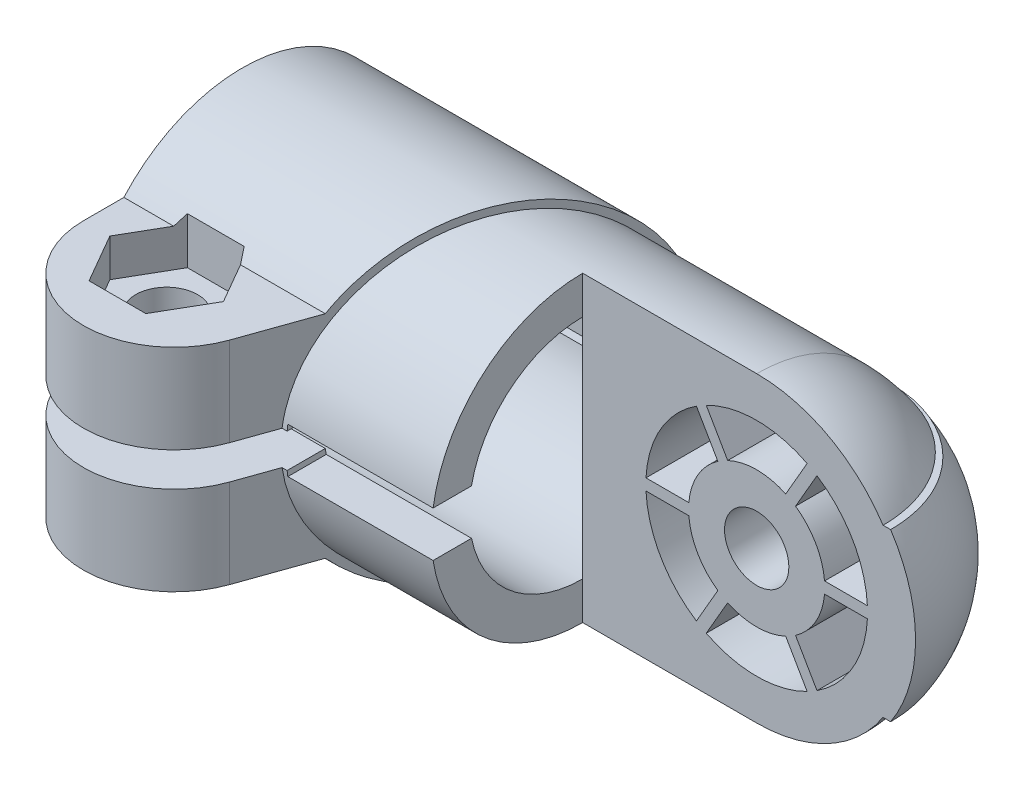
ISO-10303-21;
HEADER;
FILE_DESCRIPTION(('STEP AP214'),'2;1');
FILE_NAME('part.step','',(''),(''),'','','');
FILE_SCHEMA(('AUTOMOTIVE_DESIGN { 1 0 10303 214 1 1 1 1 }'));
ENDSEC;
DATA;
#1=APPLICATION_CONTEXT('core data for automotive mechanical design processes');
#2=APPLICATION_PROTOCOL_DEFINITION('international standard','automotive_design',2000,#1);
#3=PRODUCT_CONTEXT('',#1,'mechanical');
#4=PRODUCT('Part','Part','',(#3));
#5=PRODUCT_RELATED_PRODUCT_CATEGORY('part','',(#4));
#6=PRODUCT_DEFINITION_FORMATION('','',#4);
#7=PRODUCT_DEFINITION_CONTEXT('part definition',#1,'design');
#8=PRODUCT_DEFINITION('design','',#6,#7);
#9=PRODUCT_DEFINITION_SHAPE('','',#8);
#10=(LENGTH_UNIT() NAMED_UNIT(*) SI_UNIT(.MILLI.,.METRE.));
#11=(NAMED_UNIT(*) PLANE_ANGLE_UNIT() SI_UNIT($,.RADIAN.));
#12=(NAMED_UNIT(*) SI_UNIT($,.STERADIAN.) SOLID_ANGLE_UNIT());
#13=UNCERTAINTY_MEASURE_WITH_UNIT(LENGTH_MEASURE(1.E-05),#10,'distance_accuracy_value','');
#14=(GEOMETRIC_REPRESENTATION_CONTEXT(3) GLOBAL_UNCERTAINTY_ASSIGNED_CONTEXT((#13)) GLOBAL_UNIT_ASSIGNED_CONTEXT((#10,
#11,#12)) REPRESENTATION_CONTEXT('',''));
#15=CARTESIAN_POINT('',(0.,0.,0.));
#16=DIRECTION('',(0.,0.,1.));
#17=DIRECTION('',(1.,0.,0.));
#18=AXIS2_PLACEMENT_3D('',#15,#16,#17);
#19=CARTESIAN_POINT('',(0.,0.,0.));
#20=DIRECTION('',(1.,0.,0.));
#21=DIRECTION('',(0.,1.,0.));
#22=AXIS2_PLACEMENT_3D('',#19,#20,#21);
#23=PLANE('',#22);
#24=DIRECTION('',(0.,-1.,0.));
#25=VECTOR('',#24,1.);
#26=CARTESIAN_POINT('',(1.39645239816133E-13,-20.,0.));
#27=LINE('',#26,#25);
#28=CARTESIAN_POINT('',(-1.38777878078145E-13,20.,0.));
#29=VERTEX_POINT('',#28);
#30=CARTESIAN_POINT('',(-1.047339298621E-13,15.,0.));
#31=VERTEX_POINT('',#30);
#32=EDGE_CURVE('E26',#29,#31,#27,.T.);
#33=ORIENTED_EDGE('',*,*,#32,.F.);
#34=CARTESIAN_POINT('',(0.,0.,0.));
#35=DIRECTION('',(-1.,0.,0.));
#36=DIRECTION('',(0.,0.,1.));
#37=AXIS2_PLACEMENT_3D('',#34,#35,#36);
#38=CIRCLE('',#37,20.);
#39=CARTESIAN_POINT('',(0.,2.99999999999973,19.7737199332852));
#40=VERTEX_POINT('',#39);
#41=EDGE_CURVE('E1288',#40,#29,#38,.T.);
#42=ORIENTED_EDGE('',*,*,#41,.F.);
#43=DIRECTION('',(0.,0.,-1.));
#44=VECTOR('',#43,1.);
#45=CARTESIAN_POINT('',(0.,3.00000000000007,18.6603858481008));
#46=LINE('',#45,#44);
#47=CARTESIAN_POINT('',(0.,3.00000000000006,14.6969384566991));
#48=VERTEX_POINT('',#47);
#49=EDGE_CURVE('E877',#40,#48,#46,.T.);
#50=ORIENTED_EDGE('',*,*,#49,.T.);
#51=CARTESIAN_POINT('',(0.,0.,0.));
#52=DIRECTION('',(-1.,0.,0.));
#53=DIRECTION('',(0.,0.200000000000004,0.97979589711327));
#54=AXIS2_PLACEMENT_3D('',#51,#52,#53);
#55=CIRCLE('',#54,15.);
#56=EDGE_CURVE('E874',#48,#31,#55,.T.);
#57=ORIENTED_EDGE('',*,*,#56,.T.);
#58=EDGE_LOOP('',(#33,#42,#50,#57));
#59=FACE_BOUND('',#58,.T.);
#60=ADVANCED_FACE('F14',(#59),#23,.T.);
#61=CARTESIAN_POINT('',(1.047339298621E-13,-15.,0.));
#62=VERTEX_POINT('',#61);
#63=CARTESIAN_POINT('',(0.,-20.,0.));
#64=VERTEX_POINT('',#63);
#65=EDGE_CURVE('E9',#62,#64,#27,.T.);
#66=ORIENTED_EDGE('',*,*,#65,.F.);
#67=CARTESIAN_POINT('',(0.,0.,0.));
#68=DIRECTION('',(-1.,0.,0.));
#69=DIRECTION('',(0.,-1.,0.));
#70=AXIS2_PLACEMENT_3D('',#67,#68,#69);
#71=CIRCLE('',#70,15.);
#72=CARTESIAN_POINT('',(0.,-2.99999999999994,14.6969384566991));
#73=VERTEX_POINT('',#72);
#74=EDGE_CURVE('E887',#62,#73,#71,.T.);
#75=ORIENTED_EDGE('',*,*,#74,.T.);
#76=DIRECTION('',(0.,0.,1.));
#77=VECTOR('',#76,1.);
#78=CARTESIAN_POINT('',(0.,-2.99999999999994,14.6969384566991));
#79=LINE('',#78,#77);
#80=CARTESIAN_POINT('',(0.,-3.,19.7737199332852));
#81=VERTEX_POINT('',#80);
#82=EDGE_CURVE('E882',#81,#73,#79,.F.);
#83=ORIENTED_EDGE('',*,*,#82,.F.);
#84=EDGE_CURVE('E1293',#64,#81,#38,.T.);
#85=ORIENTED_EDGE('',*,*,#84,.F.);
#86=EDGE_LOOP('',(#66,#75,#83,#85));
#87=FACE_BOUND('',#86,.T.);
#88=ADVANCED_FACE('F1378',(#87),#23,.T.);
#89=CARTESIAN_POINT('',(-0.999999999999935,-9.,0.));
#90=DIRECTION('',(0.,-1.,0.));
#91=DIRECTION('',(1.,0.,0.));
#92=AXIS2_PLACEMENT_3D('',#89,#90,#91);
#93=PLANE('',#92);
#94=CARTESIAN_POINT('',(-34.,-9.00000000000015,21.));
#95=DIRECTION('',(0.,-1.,0.));
#96=DIRECTION('',(1.,0.,0.));
#97=AXIS2_PLACEMENT_3D('',#94,#95,#96);
#98=CIRCLE('',#97,4.1);
#99=CARTESIAN_POINT('',(-29.9,-9.00000000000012,21.));
#100=VERTEX_POINT('',#99);
#101=EDGE_CURVE('E24',#100,#100,#98,.T.);
#102=ORIENTED_EDGE('',*,*,#101,.F.);
#103=EDGE_LOOP('',(#102));
#104=FACE_BOUND('',#103,.T.);
#105=DIRECTION('',(0.499999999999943,0.,0.866025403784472));
#106=VECTOR('',#105,1.);
#107=CARTESIAN_POINT('',(-30.2472232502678,-9.00000000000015,14.5));
#108=LINE('',#107,#106);
#109=CARTESIAN_POINT('',(-30.2472232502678,-9.00000000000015,14.5));
#110=VERTEX_POINT('',#109);
#111=CARTESIAN_POINT('',(-26.494446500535,-9.0000000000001,21.));
#112=VERTEX_POINT('',#111);
#113=EDGE_CURVE('E907',#110,#112,#108,.T.);
#114=ORIENTED_EDGE('',*,*,#113,.T.);
#115=DIRECTION('',(-0.499999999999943,0.,0.866025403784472));
#116=VECTOR('',#115,1.);
#117=CARTESIAN_POINT('',(-26.494446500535,-9.0000000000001,21.));
#118=LINE('',#117,#116);
#119=CARTESIAN_POINT('',(-30.2472232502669,-9.0000000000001,27.5));
#120=VERTEX_POINT('',#119);
#121=EDGE_CURVE('E910',#112,#120,#118,.T.);
#122=ORIENTED_EDGE('',*,*,#121,.T.);
#123=DIRECTION('',(-1.,0.,0.));
#124=VECTOR('',#123,1.);
#125=CARTESIAN_POINT('',(-30.2472232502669,-9.0000000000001,27.5));
#126=LINE('',#125,#124);
#127=CARTESIAN_POINT('',(-37.7527767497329,-9.00000000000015,27.5));
#128=VERTEX_POINT('',#127);
#129=EDGE_CURVE('E913',#120,#128,#126,.T.);
#130=ORIENTED_EDGE('',*,*,#129,.T.);
#131=DIRECTION('',(-0.499999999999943,0.,-0.866025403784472));
#132=VECTOR('',#131,1.);
#133=CARTESIAN_POINT('',(-37.7527767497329,-9.00000000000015,27.5));
#134=LINE('',#133,#132);
#135=CARTESIAN_POINT('',(-41.505553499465,-9.0000000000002,21.));
#136=VERTEX_POINT('',#135);
#137=EDGE_CURVE('E916',#128,#136,#134,.T.);
#138=ORIENTED_EDGE('',*,*,#137,.T.);
#139=DIRECTION('',(0.499999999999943,0.,-0.866025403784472));
#140=VECTOR('',#139,1.);
#141=CARTESIAN_POINT('',(-41.505553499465,-9.0000000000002,21.));
#142=LINE('',#141,#140);
#143=CARTESIAN_POINT('',(-37.7527767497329,-9.0000000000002,14.5));
#144=VERTEX_POINT('',#143);
#145=EDGE_CURVE('E919',#136,#144,#142,.T.);
#146=ORIENTED_EDGE('',*,*,#145,.T.);
#147=DIRECTION('',(1.,0.,0.));
#148=VECTOR('',#147,1.);
#149=CARTESIAN_POINT('',(-37.7527767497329,-9.0000000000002,14.5));
#150=LINE('',#149,#148);
#151=EDGE_CURVE('E922',#144,#110,#150,.T.);
#152=ORIENTED_EDGE('',*,*,#151,.T.);
#153=EDGE_LOOP('',(#114,#122,#130,#138,#146,#152));
#154=FACE_BOUND('',#153,.T.);
#155=ADVANCED_FACE('F1386',(#104,#154),#93,.T.);
#156=CARTESIAN_POINT('',(-26.4944465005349,-14.,21.));
#157=DIRECTION('',(-0.866025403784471,0.,-0.499999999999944));
#158=DIRECTION('',(-0.499999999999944,0.,0.866025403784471));
#159=AXIS2_PLACEMENT_3D('',#156,#157,#158);
#160=PLANE('',#159);
#161=DIRECTION('',(0.499999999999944,0.,-0.866025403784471));
#162=VECTOR('',#161,1.);
#163=CARTESIAN_POINT('',(-30.2472232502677,-14.,27.5));
#164=LINE('',#163,#162);
#165=CARTESIAN_POINT('',(-26.4944465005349,-14.,21.));
#166=VERTEX_POINT('',#165);
#167=CARTESIAN_POINT('',(-30.2472232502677,-14.,27.5));
#168=VERTEX_POINT('',#167);
#169=EDGE_CURVE('E1231',#166,#168,#164,.F.);
#170=ORIENTED_EDGE('',*,*,#169,.T.);
#171=DIRECTION('',(0.,1.,0.));
#172=VECTOR('',#171,1.);
#173=CARTESIAN_POINT('',(-30.2472232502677,-14.,27.5));
#174=LINE('',#173,#172);
#175=EDGE_CURVE('E2010',#120,#168,#174,.F.);
#176=ORIENTED_EDGE('',*,*,#175,.F.);
#177=ORIENTED_EDGE('',*,*,#121,.F.);
#178=DIRECTION('',(0.,-1.,0.));
#179=VECTOR('',#178,1.);
#180=CARTESIAN_POINT('',(-26.494446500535,-10.,21.));
#181=LINE('',#180,#179);
#182=EDGE_CURVE('E2008',#112,#166,#181,.T.);
#183=ORIENTED_EDGE('',*,*,#182,.T.);
#184=EDGE_LOOP('',(#170,#176,#177,#183));
#185=FACE_BOUND('',#184,.T.);
#186=ADVANCED_FACE('F1393',(#185),#160,.T.);
#187=CARTESIAN_POINT('',(-30.2472232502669,-10.,27.5));
#188=DIRECTION('',(0.,0.,-1.));
#189=DIRECTION('',(0.,-1.,0.));
#190=AXIS2_PLACEMENT_3D('',#187,#188,#189);
#191=PLANE('',#190);
#192=DIRECTION('',(1.,0.,0.));
#193=VECTOR('',#192,1.);
#194=CARTESIAN_POINT('',(-37.7527767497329,-14.0000000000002,27.5));
#195=LINE('',#194,#193);
#196=CARTESIAN_POINT('',(-37.7527767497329,-14.0000000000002,27.5));
#197=VERTEX_POINT('',#196);
#198=EDGE_CURVE('E1227',#168,#197,#195,.F.);
#199=ORIENTED_EDGE('',*,*,#198,.T.);
#200=DIRECTION('',(0.,-1.,0.));
#201=VECTOR('',#200,1.);
#202=CARTESIAN_POINT('',(-37.7527767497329,-10.0000000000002,27.5));
#203=LINE('',#202,#201);
#204=EDGE_CURVE('E1292',#128,#197,#203,.T.);
#205=ORIENTED_EDGE('',*,*,#204,.F.);
#206=ORIENTED_EDGE('',*,*,#129,.F.);
#207=ORIENTED_EDGE('',*,*,#175,.T.);
#208=EDGE_LOOP('',(#199,#205,#206,#207));
#209=FACE_BOUND('',#208,.T.);
#210=ADVANCED_FACE('F1398',(#209),#191,.T.);
#211=CARTESIAN_POINT('',(-37.7527767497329,-14.0000000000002,27.5));
#212=DIRECTION('',(0.866025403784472,0.,-0.499999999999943));
#213=DIRECTION('',(-0.499999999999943,0.,-0.866025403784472));
#214=AXIS2_PLACEMENT_3D('',#211,#212,#213);
#215=PLANE('',#214);
#216=DIRECTION('',(0.499999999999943,0.,0.866025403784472));
#217=VECTOR('',#216,1.);
#218=CARTESIAN_POINT('',(-41.5055534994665,-14.0000000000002,21.));
#219=LINE('',#218,#217);
#220=CARTESIAN_POINT('',(-41.5055534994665,-14.0000000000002,21.));
#221=VERTEX_POINT('',#220);
#222=EDGE_CURVE('E1223',#197,#221,#219,.F.);
#223=ORIENTED_EDGE('',*,*,#222,.T.);
#224=DIRECTION('',(0.,-1.,0.));
#225=VECTOR('',#224,1.);
#226=CARTESIAN_POINT('',(-41.505553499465,-10.0000000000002,21.));
#227=LINE('',#226,#225);
#228=EDGE_CURVE('E1295',#136,#221,#227,.T.);
#229=ORIENTED_EDGE('',*,*,#228,.F.);
#230=ORIENTED_EDGE('',*,*,#137,.F.);
#231=ORIENTED_EDGE('',*,*,#204,.T.);
#232=EDGE_LOOP('',(#223,#229,#230,#231));
#233=FACE_BOUND('',#232,.T.);
#234=ADVANCED_FACE('F1976',(#233),#215,.T.);
#235=CARTESIAN_POINT('',(-41.5055534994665,-15.1904575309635,21.));
#236=DIRECTION('',(0.866025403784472,0.,0.499999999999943));
#237=DIRECTION('',(0.499999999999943,0.,-0.866025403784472));
#238=AXIS2_PLACEMENT_3D('',#235,#236,#237);
#239=PLANE('',#238);
#240=CARTESIAN_POINT('',(-38.4181588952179,-14.0000001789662,15.6524756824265));
#241=CARTESIAN_POINT('',(-38.205492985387,-14.4118259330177,15.2841275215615));
#242=CARTESIAN_POINT('',(-37.9835262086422,-14.8089540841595,14.8996697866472));
#243=CARTESIAN_POINT('',(-37.7527767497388,-15.1904575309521,14.5000000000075));
#244=B_SPLINE_CURVE_WITH_KNOTS('',3,(#240,#241,#242,#243),.UNSPECIFIED.,.F.,.F.,(4,4),(0.,1.),.UNSPECIFIED.);
#245=CARTESIAN_POINT('',(-38.4181588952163,-14.0000001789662,15.6524756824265));
#246=VERTEX_POINT('',#245);
#247=CARTESIAN_POINT('',(-37.7527767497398,-15.1904575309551,14.5000000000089));
#248=VERTEX_POINT('',#247);
#249=EDGE_CURVE('E1093',#246,#248,#244,.T.);
#250=ORIENTED_EDGE('',*,*,#249,.T.);
#251=DIRECTION('',(-1.32088929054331E-12,-1.,0.));
#252=VECTOR('',#251,1.);
#253=CARTESIAN_POINT('',(-37.7527767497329,-10.0000000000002,14.5));
#254=LINE('',#253,#252);
#255=EDGE_CURVE('E2014',#144,#248,#254,.T.);
#256=ORIENTED_EDGE('',*,*,#255,.F.);
#257=ORIENTED_EDGE('',*,*,#145,.F.);
#258=ORIENTED_EDGE('',*,*,#228,.T.);
#259=DIRECTION('',(-0.499999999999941,0.,0.866025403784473));
#260=VECTOR('',#259,1.);
#261=CARTESIAN_POINT('',(-38.4181588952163,-14.0000000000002,15.6524756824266));
#262=LINE('',#261,#260);
#263=EDGE_CURVE('E1219',#221,#246,#262,.F.);
#264=ORIENTED_EDGE('',*,*,#263,.T.);
#265=EDGE_LOOP('',(#250,#256,#257,#258,#264));
#266=FACE_BOUND('',#265,.T.);
#267=ADVANCED_FACE('F1980',(#266),#239,.T.);
#268=CARTESIAN_POINT('',(-30.2472232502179,-15.190457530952,14.5));
#269=DIRECTION('',(0.,0.,1.));
#270=DIRECTION('',(0.,1.,0.));
#271=AXIS2_PLACEMENT_3D('',#268,#269,#270);
#272=PLANE('',#271);
#273=DIRECTION('',(-1.,-9.67670437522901E-12,-1.01302857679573E-11));
#274=VECTOR('',#273,1.);
#275=CARTESIAN_POINT('',(-30.2472232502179,-15.1904575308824,14.5000000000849));
#276=LINE('',#275,#274);
#277=CARTESIAN_POINT('',(-30.2472232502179,-15.1904575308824,14.5000000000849));
#278=VERTEX_POINT('',#277);
#279=EDGE_CURVE('E1062',#248,#278,#276,.F.);
#280=ORIENTED_EDGE('',*,*,#279,.T.);
#281=DIRECTION('',(-9.44582748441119E-12,1.,0.));
#282=VECTOR('',#281,1.);
#283=CARTESIAN_POINT('',(-30.2472232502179,-15.1904575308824,14.5));
#284=LINE('',#283,#282);
#285=EDGE_CURVE('E2018',#110,#278,#284,.F.);
#286=ORIENTED_EDGE('',*,*,#285,.F.);
#287=ORIENTED_EDGE('',*,*,#151,.F.);
#288=ORIENTED_EDGE('',*,*,#255,.T.);
#289=EDGE_LOOP('',(#280,#286,#287,#288));
#290=FACE_BOUND('',#289,.T.);
#291=ADVANCED_FACE('F1985',(#290),#272,.T.);
#292=CARTESIAN_POINT('',(-30.2472232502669,-15.1904575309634,14.5));
#293=DIRECTION('',(-0.866025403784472,0.,0.499999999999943));
#294=DIRECTION('',(0.499999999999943,0.,0.866025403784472));
#295=AXIS2_PLACEMENT_3D('',#292,#293,#294);
#296=PLANE('',#295);
#297=CARTESIAN_POINT('',(-30.2472232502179,-15.1904575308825,14.5000000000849));
#298=CARTESIAN_POINT('',(-30.0164737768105,-14.8089540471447,14.8996698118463));
#299=CARTESIAN_POINT('',(-29.794506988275,-14.4118258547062,15.2841275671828));
#300=CARTESIAN_POINT('',(-29.581841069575,-14.0000000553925,15.6524757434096));
#301=B_SPLINE_CURVE_WITH_KNOTS('',3,(#297,#298,#299,#300),.UNSPECIFIED.,.F.,.F.,(4,4),(0.,1.),.UNSPECIFIED.);
#302=CARTESIAN_POINT('',(-29.581841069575,-14.0000000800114,15.6524757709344));
#303=VERTEX_POINT('',#302);
#304=EDGE_CURVE('E1073',#278,#303,#301,.T.);
#305=ORIENTED_EDGE('',*,*,#304,.T.);
#306=DIRECTION('',(-0.499999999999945,0.,-0.866025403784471));
#307=VECTOR('',#306,1.);
#308=CARTESIAN_POINT('',(-26.4944465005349,-14.,21.));
#309=LINE('',#308,#307);
#310=EDGE_CURVE('E1203',#303,#166,#309,.F.);
#311=ORIENTED_EDGE('',*,*,#310,.T.);
#312=ORIENTED_EDGE('',*,*,#182,.F.);
#313=ORIENTED_EDGE('',*,*,#113,.F.);
#314=ORIENTED_EDGE('',*,*,#285,.T.);
#315=EDGE_LOOP('',(#305,#311,#312,#313,#314));
#316=FACE_BOUND('',#315,.T.);
#317=ADVANCED_FACE('F1369',(#316),#296,.T.);
#318=CARTESIAN_POINT('',(-30.2472232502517,9.99999999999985,14.5));
#319=DIRECTION('',(0.,0.,1.));
#320=DIRECTION('',(0.,1.,0.));
#321=AXIS2_PLACEMENT_3D('',#318,#319,#320);
#322=PLANE('',#321);
#323=DIRECTION('',(1.,-1.53807419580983E-11,1.61202257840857E-11));
#324=VECTOR('',#323,1.);
#325=CARTESIAN_POINT('',(-37.7527767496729,15.1904575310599,14.4999999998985));
#326=LINE('',#325,#324);
#327=CARTESIAN_POINT('',(-30.2472232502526,15.1904575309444,14.5000000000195));
#328=VERTEX_POINT('',#327);
#329=CARTESIAN_POINT('',(-37.7527767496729,15.1904575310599,14.4999999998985));
#330=VERTEX_POINT('',#329);
#331=EDGE_CURVE('E1120',#328,#330,#326,.F.);
#332=ORIENTED_EDGE('',*,*,#331,.T.);
#333=DIRECTION('',(-1.1270348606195E-11,-1.,0.));
#334=VECTOR('',#333,1.);
#335=CARTESIAN_POINT('',(-37.7527767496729,15.1904575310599,14.5));
#336=LINE('',#335,#334);
#337=CARTESIAN_POINT('',(-37.7527767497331,9.99999999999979,14.5));
#338=VERTEX_POINT('',#337);
#339=EDGE_CURVE('E1131',#330,#338,#336,.T.);
#340=ORIENTED_EDGE('',*,*,#339,.T.);
#341=DIRECTION('',(0.,1.,0.));
#342=VECTOR('',#341,1.);
#343=CARTESIAN_POINT('',(-37.7527767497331,8.99999999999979,14.5));
#344=LINE('',#343,#342);
#345=CARTESIAN_POINT('',(-37.7527767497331,8.99999999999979,14.5));
#346=VERTEX_POINT('',#345);
#347=EDGE_CURVE('E946',#346,#338,#344,.T.);
#348=ORIENTED_EDGE('',*,*,#347,.F.);
#349=DIRECTION('',(-1.,0.,0.));
#350=VECTOR('',#349,1.);
#351=CARTESIAN_POINT('',(-30.2472232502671,8.99999999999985,14.5));
#352=LINE('',#351,#350);
#353=CARTESIAN_POINT('',(-30.2472232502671,8.99999999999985,14.5));
#354=VERTEX_POINT('',#353);
#355=EDGE_CURVE('E937',#354,#346,#352,.T.);
#356=ORIENTED_EDGE('',*,*,#355,.F.);
#357=DIRECTION('',(2.94582162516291E-12,1.,0.));
#358=VECTOR('',#357,1.);
#359=CARTESIAN_POINT('',(-30.2472232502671,9.99999999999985,14.5));
#360=LINE('',#359,#358);
#361=EDGE_CURVE('E1133',#328,#354,#360,.F.);
#362=ORIENTED_EDGE('',*,*,#361,.F.);
#363=EDGE_LOOP('',(#332,#340,#348,#356,#362));
#364=FACE_BOUND('',#363,.T.);
#365=ADVANCED_FACE('F1130',(#364),#322,.T.);
#366=CARTESIAN_POINT('',(-41.505553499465,9.99999999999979,21.));
#367=DIRECTION('',(0.866025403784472,0.,0.499999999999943));
#368=DIRECTION('',(0.499999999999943,0.,-0.866025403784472));
#369=AXIS2_PLACEMENT_3D('',#366,#367,#368);
#370=PLANE('',#369);
#371=CARTESIAN_POINT('',(-37.7527767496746,15.1904575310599,14.4999999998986));
#372=CARTESIAN_POINT('',(-37.983526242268,14.8089540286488,14.8996698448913));
#373=CARTESIAN_POINT('',(-38.2054930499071,14.4118258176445,15.2841276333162));
#374=CARTESIAN_POINT('',(-38.4181589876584,13.9999999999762,15.6524758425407));
#375=B_SPLINE_CURVE_WITH_KNOTS('',3,(#371,#372,#373,#374),.UNSPECIFIED.,.F.,.F.,(4,4),(0.,1.),.UNSPECIFIED.);
#376=CARTESIAN_POINT('',(-38.4181589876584,13.9999999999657,15.6524758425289));
#377=VERTEX_POINT('',#376);
#378=EDGE_CURVE('E1114',#330,#377,#375,.T.);
#379=ORIENTED_EDGE('',*,*,#378,.T.);
#380=DIRECTION('',(0.499999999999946,0.,-0.86602540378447));
#381=VECTOR('',#380,1.);
#382=CARTESIAN_POINT('',(-41.5055534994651,13.9999999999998,21.));
#383=LINE('',#382,#381);
#384=CARTESIAN_POINT('',(-41.5055534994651,13.9999999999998,21.));
#385=VERTEX_POINT('',#384);
#386=EDGE_CURVE('E1253',#385,#377,#383,.T.);
#387=ORIENTED_EDGE('',*,*,#386,.F.);
#388=DIRECTION('',(0.,-1.,0.));
#389=VECTOR('',#388,1.);
#390=CARTESIAN_POINT('',(-41.5055534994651,13.9999999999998,21.));
#391=LINE('',#390,#389);
#392=CARTESIAN_POINT('',(-41.505553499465,8.99999999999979,21.));
#393=VERTEX_POINT('',#392);
#394=EDGE_CURVE('E2030',#385,#393,#391,.T.);
#395=ORIENTED_EDGE('',*,*,#394,.T.);
#396=DIRECTION('',(-0.499999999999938,0.,0.866025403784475));
#397=VECTOR('',#396,1.);
#398=CARTESIAN_POINT('',(-37.7527767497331,8.99999999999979,14.5));
#399=LINE('',#398,#397);
#400=EDGE_CURVE('E940',#346,#393,#399,.T.);
#401=ORIENTED_EDGE('',*,*,#400,.F.);
#402=ORIENTED_EDGE('',*,*,#347,.T.);
#403=ORIENTED_EDGE('',*,*,#339,.F.);
#404=EDGE_LOOP('',(#379,#387,#395,#401,#402,#403));
#405=FACE_BOUND('',#404,.T.);
#406=ADVANCED_FACE('F1364',(#405),#370,.T.);
#407=CARTESIAN_POINT('',(-37.7527767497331,9.99999999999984,27.5));
#408=DIRECTION('',(0.866025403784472,0.,-0.499999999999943));
#409=DIRECTION('',(-0.499999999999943,0.,-0.866025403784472));
#410=AXIS2_PLACEMENT_3D('',#407,#408,#409);
#411=PLANE('',#410);
#412=DIRECTION('',(0.,-1.,0.));
#413=VECTOR('',#412,1.);
#414=CARTESIAN_POINT('',(-37.7527767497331,13.9999999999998,27.5));
#415=LINE('',#414,#413);
#416=CARTESIAN_POINT('',(-37.7527767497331,13.9999999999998,27.5));
#417=VERTEX_POINT('',#416);
#418=CARTESIAN_POINT('',(-37.7527767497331,8.99999999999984,27.5));
#419=VERTEX_POINT('',#418);
#420=EDGE_CURVE('E2022',#417,#419,#415,.T.);
#421=ORIENTED_EDGE('',*,*,#420,.T.);
#422=DIRECTION('',(0.499999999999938,0.,0.866025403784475));
#423=VECTOR('',#422,1.);
#424=CARTESIAN_POINT('',(-41.505553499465,8.99999999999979,21.));
#425=LINE('',#424,#423);
#426=EDGE_CURVE('E943',#393,#419,#425,.T.);
#427=ORIENTED_EDGE('',*,*,#426,.F.);
#428=ORIENTED_EDGE('',*,*,#394,.F.);
#429=DIRECTION('',(-0.499999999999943,0.,-0.866025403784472));
#430=VECTOR('',#429,1.);
#431=CARTESIAN_POINT('',(-37.7527767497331,13.9999999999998,27.5));
#432=LINE('',#431,#430);
#433=EDGE_CURVE('E1248',#417,#385,#432,.T.);
#434=ORIENTED_EDGE('',*,*,#433,.F.);
#435=EDGE_LOOP('',(#421,#427,#428,#434));
#436=FACE_BOUND('',#435,.T.);
#437=ADVANCED_FACE('F2055',(#436),#411,.T.);
#438=CARTESIAN_POINT('',(-30.2472232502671,14.,27.5));
#439=DIRECTION('',(0.,0.,-1.));
#440=DIRECTION('',(0.,-1.,0.));
#441=AXIS2_PLACEMENT_3D('',#438,#439,#440);
#442=PLANE('',#441);
#443=DIRECTION('',(0.,1.,0.));
#444=VECTOR('',#443,1.);
#445=CARTESIAN_POINT('',(-30.2472232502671,9.99999999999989,27.5));
#446=LINE('',#445,#444);
#447=CARTESIAN_POINT('',(-30.2472232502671,14.,27.5));
#448=VERTEX_POINT('',#447);
#449=CARTESIAN_POINT('',(-30.2472232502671,8.99999999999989,27.5));
#450=VERTEX_POINT('',#449);
#451=EDGE_CURVE('E2026',#448,#450,#446,.F.);
#452=ORIENTED_EDGE('',*,*,#451,.T.);
#453=DIRECTION('',(1.,0.,0.));
#454=VECTOR('',#453,1.);
#455=CARTESIAN_POINT('',(-37.7527767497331,8.99999999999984,27.5));
#456=LINE('',#455,#454);
#457=EDGE_CURVE('E928',#419,#450,#456,.T.);
#458=ORIENTED_EDGE('',*,*,#457,.F.);
#459=ORIENTED_EDGE('',*,*,#420,.F.);
#460=DIRECTION('',(-1.,0.,0.));
#461=VECTOR('',#460,1.);
#462=CARTESIAN_POINT('',(-30.2472232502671,14.,27.5));
#463=LINE('',#462,#461);
#464=EDGE_CURVE('E1243',#448,#417,#463,.T.);
#465=ORIENTED_EDGE('',*,*,#464,.F.);
#466=EDGE_LOOP('',(#452,#458,#459,#465));
#467=FACE_BOUND('',#466,.T.);
#468=ADVANCED_FACE('F2052',(#467),#442,.T.);
#469=CARTESIAN_POINT('',(-26.4944465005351,10.,21.));
#470=DIRECTION('',(-0.866025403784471,0.,-0.499999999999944));
#471=DIRECTION('',(-0.499999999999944,0.,0.866025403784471));
#472=AXIS2_PLACEMENT_3D('',#469,#470,#471);
#473=PLANE('',#472);
#474=DIRECTION('',(0.,1.,0.));
#475=VECTOR('',#474,1.);
#476=CARTESIAN_POINT('',(-26.4944465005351,10.,21.));
#477=LINE('',#476,#475);
#478=CARTESIAN_POINT('',(-26.4944465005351,14.,21.));
#479=VERTEX_POINT('',#478);
#480=CARTESIAN_POINT('',(-26.4944465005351,8.99999999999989,21.));
#481=VERTEX_POINT('',#480);
#482=EDGE_CURVE('E1344',#479,#481,#477,.F.);
#483=ORIENTED_EDGE('',*,*,#482,.T.);
#484=DIRECTION('',(0.499999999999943,0.,-0.866025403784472));
#485=VECTOR('',#484,1.);
#486=CARTESIAN_POINT('',(-30.2472232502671,8.99999999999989,27.5));
#487=LINE('',#486,#485);
#488=EDGE_CURVE('E931',#450,#481,#487,.T.);
#489=ORIENTED_EDGE('',*,*,#488,.F.);
#490=ORIENTED_EDGE('',*,*,#451,.F.);
#491=DIRECTION('',(-0.499999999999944,0.,0.866025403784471));
#492=VECTOR('',#491,1.);
#493=CARTESIAN_POINT('',(-26.4944465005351,14.,21.));
#494=LINE('',#493,#492);
#495=EDGE_CURVE('E1239',#479,#448,#494,.T.);
#496=ORIENTED_EDGE('',*,*,#495,.F.);
#497=EDGE_LOOP('',(#483,#489,#490,#496));
#498=FACE_BOUND('',#497,.T.);
#499=ADVANCED_FACE('F1363',(#498),#473,.T.);
#500=CARTESIAN_POINT('',(-30.2472232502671,9.99999999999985,14.5));
#501=DIRECTION('',(-0.866025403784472,0.,0.499999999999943));
#502=DIRECTION('',(0.499999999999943,0.,0.866025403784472));
#503=AXIS2_PLACEMENT_3D('',#500,#501,#502);
#504=PLANE('',#503);
#505=CARTESIAN_POINT('',(-29.581841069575,14.0000001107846,15.6524757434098));
#506=CARTESIAN_POINT('',(-29.794506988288,14.4118258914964,15.2841275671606));
#507=CARTESIAN_POINT('',(-30.0164737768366,14.8089540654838,14.8996698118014));
#508=CARTESIAN_POINT('',(-30.2472232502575,15.1904575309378,14.5000000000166));
#509=B_SPLINE_CURVE_WITH_KNOTS('',3,(#505,#506,#507,#508),.UNSPECIFIED.,.F.,.F.,(4,4),(0.,1.),.UNSPECIFIED.);
#510=CARTESIAN_POINT('',(-29.5818410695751,14.0000001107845,15.6524757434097));
#511=VERTEX_POINT('',#510);
#512=EDGE_CURVE('E1134',#511,#328,#509,.T.);
#513=ORIENTED_EDGE('',*,*,#512,.T.);
#514=ORIENTED_EDGE('',*,*,#361,.T.);
#515=DIRECTION('',(-0.499999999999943,0.,-0.866025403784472));
#516=VECTOR('',#515,1.);
#517=CARTESIAN_POINT('',(-26.4944465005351,8.99999999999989,21.));
#518=LINE('',#517,#516);
#519=EDGE_CURVE('E934',#481,#354,#518,.T.);
#520=ORIENTED_EDGE('',*,*,#519,.F.);
#521=ORIENTED_EDGE('',*,*,#482,.F.);
#522=DIRECTION('',(0.499999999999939,0.,0.866025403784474));
#523=VECTOR('',#522,1.);
#524=CARTESIAN_POINT('',(-29.5818410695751,13.9999999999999,15.6524757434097));
#525=LINE('',#524,#523);
#526=EDGE_CURVE('E1147',#511,#479,#525,.T.);
#527=ORIENTED_EDGE('',*,*,#526,.F.);
#528=EDGE_LOOP('',(#513,#514,#520,#521,#527));
#529=FACE_BOUND('',#528,.T.);
#530=ADVANCED_FACE('F1352',(#529),#504,.T.);
#531=CARTESIAN_POINT('',(-1.00000000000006,9.,0.));
#532=DIRECTION('',(0.,1.,0.));
#533=DIRECTION('',(-1.,0.,0.));
#534=AXIS2_PLACEMENT_3D('',#531,#532,#533);
#535=PLANE('',#534);
#536=CARTESIAN_POINT('',(-34.,8.99999999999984,21.));
#537=DIRECTION('',(0.,1.,0.));
#538=DIRECTION('',(-1.,0.,0.));
#539=AXIS2_PLACEMENT_3D('',#536,#537,#538);
#540=CIRCLE('',#539,4.1);
#541=CARTESIAN_POINT('',(-38.1,8.99999999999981,21.));
#542=VERTEX_POINT('',#541);
#543=EDGE_CURVE('E925',#542,#542,#540,.T.);
#544=ORIENTED_EDGE('',*,*,#543,.F.);
#545=EDGE_LOOP('',(#544));
#546=FACE_BOUND('',#545,.T.);
#547=ORIENTED_EDGE('',*,*,#457,.T.);
#548=ORIENTED_EDGE('',*,*,#488,.T.);
#549=ORIENTED_EDGE('',*,*,#519,.T.);
#550=ORIENTED_EDGE('',*,*,#355,.T.);
#551=ORIENTED_EDGE('',*,*,#400,.T.);
#552=ORIENTED_EDGE('',*,*,#426,.T.);
#553=EDGE_LOOP('',(#547,#548,#549,#550,#551,#552));
#554=FACE_BOUND('',#553,.T.);
#555=ADVANCED_FACE('F1362',(#546,#554),#535,.T.);
#556=CARTESIAN_POINT('',(-34.0000000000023,100.,20.9999999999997));
#557=DIRECTION('',(0.,-1.,0.));
#558=DIRECTION('',(-1.,0.,0.));
#559=AXIS2_PLACEMENT_3D('',#556,#557,#558);
#560=CYLINDRICAL_SURFACE('',#559,4.1);
#561=CARTESIAN_POINT('',(-34.0000000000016,-2.25000000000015,21.));
#562=DIRECTION('',(0.,-1.,0.));
#563=DIRECTION('',(-1.,0.,0.));
#564=AXIS2_PLACEMENT_3D('',#561,#562,#563);
#565=CIRCLE('',#564,4.1);
#566=CARTESIAN_POINT('',(-38.1000000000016,-2.25000000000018,21.));
#567=VERTEX_POINT('',#566);
#568=EDGE_CURVE('E2209',#567,#567,#565,.T.);
#569=ORIENTED_EDGE('',*,*,#568,.F.);
#570=EDGE_LOOP('',(#569));
#571=FACE_BOUND('',#570,.T.);
#572=ORIENTED_EDGE('',*,*,#101,.T.);
#573=EDGE_LOOP('',(#572));
#574=FACE_BOUND('',#573,.T.);
#575=ADVANCED_FACE('F1406',(#571,#574),#560,.F.);
#576=CARTESIAN_POINT('',(-33.,13.9999999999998,21.));
#577=DIRECTION('',(0.,-1.,0.));
#578=DIRECTION('',(0.942661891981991,0.,0.333749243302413));
#579=AXIS2_PLACEMENT_3D('',#576,#577,#578);
#580=CYLINDRICAL_SURFACE('',#579,12.);
#581=CARTESIAN_POINT('',(-33.0000000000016,-2.25000000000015,21.));
#582=DIRECTION('',(0.,1.,0.));
#583=DIRECTION('',(-1.,0.,0.));
#584=AXIS2_PLACEMENT_3D('',#581,#582,#583);
#585=CIRCLE('',#584,12.);
#586=CARTESIAN_POINT('',(-45.0000000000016,-2.25000000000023,21.));
#587=VERTEX_POINT('',#586);
#588=CARTESIAN_POINT('',(-21.6880572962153,-2.25000000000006,25.004990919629));
#589=VERTEX_POINT('',#588);
#590=EDGE_CURVE('E2197',#587,#589,#585,.T.);
#591=ORIENTED_EDGE('',*,*,#590,.F.);
#592=DIRECTION('',(0.,1.,0.));
#593=VECTOR('',#592,1.);
#594=CARTESIAN_POINT('',(-45.0000000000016,-14.0000000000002,21.));
#595=LINE('',#594,#593);
#596=CARTESIAN_POINT('',(-45.0000000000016,-14.0000000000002,21.));
#597=VERTEX_POINT('',#596);
#598=EDGE_CURVE('E2212',#587,#597,#595,.F.);
#599=ORIENTED_EDGE('',*,*,#598,.T.);
#600=CARTESIAN_POINT('',(-33.0000000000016,-14.0000000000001,21.));
#601=DIRECTION('',(0.,-1.,0.));
#602=DIRECTION('',(0.942661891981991,0.,0.333749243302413));
#603=AXIS2_PLACEMENT_3D('',#600,#601,#602);
#604=CIRCLE('',#603,12.);
#605=CARTESIAN_POINT('',(-21.6880572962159,-14.,25.004990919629));
#606=VERTEX_POINT('',#605);
#607=EDGE_CURVE('E1206',#597,#606,#604,.F.);
#608=ORIENTED_EDGE('',*,*,#607,.T.);
#609=DIRECTION('',(0.,-1.,0.));
#610=VECTOR('',#609,1.);
#611=CARTESIAN_POINT('',(-21.6880572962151,-2.25000000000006,25.004990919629));
#612=LINE('',#611,#610);
#613=EDGE_CURVE('E1331',#589,#606,#612,.T.);
#614=ORIENTED_EDGE('',*,*,#613,.F.);
#615=EDGE_LOOP('',(#591,#599,#608,#614));
#616=FACE_BOUND('',#615,.T.);
#617=ADVANCED_FACE('F1971',(#616),#580,.T.);
#618=CARTESIAN_POINT('',(-18.3768012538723,-14.,15.6524756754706));
#619=DIRECTION('',(0.,-1.,0.));
#620=DIRECTION('',(0.,0.,1.));
#621=AXIS2_PLACEMENT_3D('',#618,#619,#620);
#622=PLANE('',#621);
#623=ORIENTED_EDGE('',*,*,#310,.F.);
#624=DIRECTION('',(-1.,9.52532434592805E-09,8.51971527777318E-09));
#625=VECTOR('',#624,1.);
#626=CARTESIAN_POINT('',(-18.3768012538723,-14.000000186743,15.6524756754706));
#627=LINE('',#626,#625);
#628=CARTESIAN_POINT('',(-18.3768012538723,-14.000000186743,15.6524756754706));
#629=VERTEX_POINT('',#628);
#630=EDGE_CURVE('E1077',#303,#629,#627,.F.);
#631=ORIENTED_EDGE('',*,*,#630,.T.);
#632=DIRECTION('',(-0.333749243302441,0.,0.942661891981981));
#633=VECTOR('',#632,1.);
#634=CARTESIAN_POINT('',(-18.3768012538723,-14.,15.6524756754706));
#635=LINE('',#634,#633);
#636=EDGE_CURVE('E1204',#606,#629,#635,.F.);
#637=ORIENTED_EDGE('',*,*,#636,.F.);
#638=ORIENTED_EDGE('',*,*,#607,.F.);
#639=DIRECTION('',(0.,0.,-1.));
#640=VECTOR('',#639,1.);
#641=CARTESIAN_POINT('',(-45.0000000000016,-14.0000000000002,21.));
#642=LINE('',#641,#640);
#643=CARTESIAN_POINT('',(-45.,-14.0000000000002,15.6524758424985));
#644=VERTEX_POINT('',#643);
#645=EDGE_CURVE('E1214',#644,#597,#642,.F.);
#646=ORIENTED_EDGE('',*,*,#645,.F.);
#647=DIRECTION('',(-1.,2.71908610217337E-08,2.43202516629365E-08));
#648=VECTOR('',#647,1.);
#649=CARTESIAN_POINT('',(-38.4181588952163,-14.0000001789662,15.6524756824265));
#650=LINE('',#649,#648);
#651=EDGE_CURVE('E1096',#644,#246,#650,.F.);
#652=ORIENTED_EDGE('',*,*,#651,.T.);
#653=ORIENTED_EDGE('',*,*,#263,.F.);
#654=ORIENTED_EDGE('',*,*,#222,.F.);
#655=ORIENTED_EDGE('',*,*,#198,.F.);
#656=ORIENTED_EDGE('',*,*,#169,.F.);
#657=EDGE_LOOP('',(#623,#631,#637,#638,#646,#652,#653,#654,#655,#656));
#658=FACE_BOUND('',#657,.T.);
#659=ADVANCED_FACE('F1022',(#658),#622,.T.);
#660=CARTESIAN_POINT('',(-45.,-3.07250357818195E-13,0.));
#661=DIRECTION('',(-1.,0.,0.));
#662=DIRECTION('',(0.,3.12283532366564E-12,-1.));
#663=AXIS2_PLACEMENT_3D('',#660,#661,#662);
#664=CYLINDRICAL_SURFACE('',#663,21.);
#665=ORIENTED_EDGE('',*,*,#651,.F.);
#666=CARTESIAN_POINT('',(-45.,-3.07250357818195E-13,0.));
#667=DIRECTION('',(1.,0.,0.));
#668=DIRECTION('',(0.,-0.666666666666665,0.745355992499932));
#669=AXIS2_PLACEMENT_3D('',#666,#667,#668);
#670=CIRCLE('',#669,21.);
#671=CARTESIAN_POINT('',(-45.,13.9999999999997,15.6524758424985));
#672=VERTEX_POINT('',#671);
#673=EDGE_CURVE('E1101',#672,#644,#670,.F.);
#674=ORIENTED_EDGE('',*,*,#673,.F.);
#675=DIRECTION('',(1.,-5.16838038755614E-12,4.62911098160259E-12));
#676=VECTOR('',#675,1.);
#677=CARTESIAN_POINT('',(-45.,13.9999999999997,15.6524758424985));
#678=LINE('',#677,#676);
#679=EDGE_CURVE('E1105',#672,#377,#678,.T.);
#680=ORIENTED_EDGE('',*,*,#679,.T.);
#681=ORIENTED_EDGE('',*,*,#378,.F.);
#682=ORIENTED_EDGE('',*,*,#331,.F.);
#683=ORIENTED_EDGE('',*,*,#512,.F.);
#684=DIRECTION('',(1.,-9.62312259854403E-09,8.60718865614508E-09));
#685=VECTOR('',#684,1.);
#686=CARTESIAN_POINT('',(-29.5818410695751,14.0000001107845,15.6524757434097));
#687=LINE('',#686,#685);
#688=CARTESIAN_POINT('',(-18.3768013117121,14.000000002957,15.6524758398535));
#689=VERTEX_POINT('',#688);
#690=EDGE_CURVE('E1135',#511,#689,#687,.T.);
#691=ORIENTED_EDGE('',*,*,#690,.T.);
#692=CARTESIAN_POINT('',(-5.96064221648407,8.00000048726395,-19.4164876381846));
#693=CARTESIAN_POINT('',(-6.30627257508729,10.3693449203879,-18.4402679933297));
#694=CARTESIAN_POINT('',(-6.80252068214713,12.5400055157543,-17.0386343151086));
#695=CARTESIAN_POINT('',(-7.98592250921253,16.0857868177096,-13.6961614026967));
#696=CARTESIAN_POINT('',(-8.64198947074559,17.4955904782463,-11.8431255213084));
#697=CARTESIAN_POINT('',(-10.1077021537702,19.679461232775,-7.70327646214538));
#698=CARTESIAN_POINT('',(-10.9111121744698,20.4262796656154,-5.434075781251));
#699=CARTESIAN_POINT('',(-12.4348270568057,21.0603345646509,-1.13040174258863));
#700=CARTESIAN_POINT('',(-13.1247575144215,21.073127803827,0.818280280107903));
#701=CARTESIAN_POINT('',(-14.4807890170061,20.5700766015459,4.64833906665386));
#702=CARTESIAN_POINT('',(-15.146890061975,20.0542321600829,6.52971583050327));
#703=CARTESIAN_POINT('',(-16.4662352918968,18.4458794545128,10.2561556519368));
#704=CARTESIAN_POINT('',(-17.1035104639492,17.3241699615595,12.0561148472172));
#705=CARTESIAN_POINT('',(-17.920825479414,15.3469544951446,14.3645896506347));
#706=CARTESIAN_POINT('',(-18.1567529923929,14.694878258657,15.0309578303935));
#707=CARTESIAN_POINT('',(-18.3768013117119,14.0000000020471,15.6524758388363));
#708=B_SPLINE_CURVE_WITH_KNOTS('',3,(#692,#693,#694,#695,#696,#697,#698,#699,#700,#701,#702,
#703,#704,#705,#706,#707),.UNSPECIFIED.,.F.,.F.,(4,2,2,2,2,2,2,4),(0.,0.182064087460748,
0.346202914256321,0.514740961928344,0.651339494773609,0.787938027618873,0.93539626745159,1.),.UNSPECIFIED.);
#709=CARTESIAN_POINT('',(-5.96064214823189,8.00000001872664,-19.4164878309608));
#710=VERTEX_POINT('',#709);
#711=EDGE_CURVE('E1151',#710,#689,#708,.T.);
#712=ORIENTED_EDGE('',*,*,#711,.F.);
#713=CARTESIAN_POINT('',(-12.8350455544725,0.,0.));
#714=DIRECTION('',(0.942661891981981,0.,0.333749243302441));
#715=DIRECTION('',(-0.333749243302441,0.,0.942661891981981));
#716=AXIS2_PLACEMENT_3D('',#713,#714,#715);
#717=ELLIPSE('',#716,22.2773405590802,20.9999999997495);
#718=CARTESIAN_POINT('',(-5.75404978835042,6.40312423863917,-19.9999999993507));
#719=VERTEX_POINT('',#718);
#720=EDGE_CURVE('E989',#719,#710,#717,.T.);
#721=ORIENTED_EDGE('',*,*,#720,.F.);
#722=CARTESIAN_POINT('',(-5.39999993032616,4.21598519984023E-11,-21.0000001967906));
#723=CARTESIAN_POINT('',(-5.39999948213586,0.235321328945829,-21.0000014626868));
#724=CARTESIAN_POINT('',(-5.40139425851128,0.470700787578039,-20.9960619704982));
#725=CARTESIAN_POINT('',(-5.40761661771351,0.994674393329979,-20.9784871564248));
#726=CARTESIAN_POINT('',(-5.41315343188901,1.28296759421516,-20.9628486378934));
#727=CARTESIAN_POINT('',(-5.42832038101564,1.85415603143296,-20.9200101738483));
#728=CARTESIAN_POINT('',(-5.43788723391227,2.13706687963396,-20.8929889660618));
#729=CARTESIAN_POINT('',(-5.46925883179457,2.90044904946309,-20.8043810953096));
#730=CARTESIAN_POINT('',(-5.49393918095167,3.35868244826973,-20.7346723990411));
#731=CARTESIAN_POINT('',(-5.56433800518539,4.43787085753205,-20.5358336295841));
#732=CARTESIAN_POINT('',(-5.61372400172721,5.03587941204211,-20.3963447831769));
#733=CARTESIAN_POINT('',(-5.69693187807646,5.88187407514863,-20.1613273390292));
#734=CARTESIAN_POINT('',(-5.7245849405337,6.14318059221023,-20.0832223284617));
#735=CARTESIAN_POINT('',(-5.75404978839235,6.40312423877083,-19.999999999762));
#736=B_SPLINE_CURVE_WITH_KNOTS('',3,(#722,#723,#724,#725,#726,#727,#728,#729,#730,#731,#732,
#733,#734,#735),.UNSPECIFIED.,.F.,.F.,(4,2,2,2,2,2,4),(0.,0.103072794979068,0.229661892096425,
0.3543332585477,0.566663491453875,0.865452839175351,1.),.UNSPECIFIED.);
#737=CARTESIAN_POINT('',(-5.39999937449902,4.21587706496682E-11,-21.));
#738=VERTEX_POINT('',#737);
#739=EDGE_CURVE('E1152',#738,#719,#736,.T.);
#740=ORIENTED_EDGE('',*,*,#739,.F.);
#741=CARTESIAN_POINT('',(-5.75405018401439,-6.40312772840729,-19.9999988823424));
#742=CARTESIAN_POINT('',(-5.69550772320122,-5.88665668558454,-20.1653498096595));
#743=CARTESIAN_POINT('',(-5.64407020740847,-5.3639745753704,-20.3106330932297));
#744=CARTESIAN_POINT('',(-5.55660247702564,-4.32006875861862,-20.5576823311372));
#745=CARTESIAN_POINT('',(-5.5195989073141,-3.79292233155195,-20.6621974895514));
#746=CARTESIAN_POINT('',(-5.47180208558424,-2.92849746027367,-20.7971977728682));
#747=CARTESIAN_POINT('',(-5.45705833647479,-2.61600280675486,-20.8388409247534));
#748=CARTESIAN_POINT('',(-5.43093792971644,-1.94778737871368,-20.9126170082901));
#749=CARTESIAN_POINT('',(-5.42010246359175,-1.58844565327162,-20.9432213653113));
#750=CARTESIAN_POINT('',(-5.40416993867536,-0.813335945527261,-20.9882221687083));
#751=CARTESIAN_POINT('',(-5.40000065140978,-0.406754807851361,-20.9999981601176));
#752=CARTESIAN_POINT('',(-5.39999993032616,4.21598519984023E-11,-21.0000001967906));
#753=B_SPLINE_CURVE_WITH_KNOTS('',3,(#741,#742,#743,#744,#745,#746,#747,#748,#749,#750,#751,
#752),.UNSPECIFIED.,.F.,.F.,(4,2,2,2,2,4),(0.,0.260315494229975,0.514943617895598,
0.658664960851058,0.821660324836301,1.),.UNSPECIFIED.);
#754=CARTESIAN_POINT('',(-5.75405015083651,-6.40312743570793,-19.9999989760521));
#755=VERTEX_POINT('',#754);
#756=EDGE_CURVE('E1000',#755,#738,#753,.T.);
#757=ORIENTED_EDGE('',*,*,#756,.F.);
#758=CARTESIAN_POINT('',(-12.8350455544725,0.,0.));
#759=DIRECTION('',(0.942661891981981,0.,0.333749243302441));
#760=DIRECTION('',(-0.333749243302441,0.,0.942661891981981));
#761=AXIS2_PLACEMENT_3D('',#758,#759,#760);
#762=ELLIPSE('',#761,22.277340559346,21.);
#763=CARTESIAN_POINT('',(-5.96064225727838,-8.00000076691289,-19.4164875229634));
#764=VERTEX_POINT('',#763);
#765=EDGE_CURVE('E991',#764,#755,#762,.T.);
#766=ORIENTED_EDGE('',*,*,#765,.F.);
#767=CARTESIAN_POINT('',(-18.376801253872,-14.000000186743,15.6524756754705));
#768=CARTESIAN_POINT('',(-17.9936684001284,-15.2098738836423,14.5703316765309));
#769=CARTESIAN_POINT('',(-17.56697814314,-16.2772640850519,13.3651614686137));
#770=CARTESIAN_POINT('',(-16.5892899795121,-18.2121368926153,10.6037188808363));
#771=CARTESIAN_POINT('',(-16.0379300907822,-19.0329379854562,9.04642409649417));
#772=CARTESIAN_POINT('',(-14.8806820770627,-20.2642170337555,5.77782162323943));
#773=CARTESIAN_POINT('',(-14.2891043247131,-20.6650087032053,4.10693303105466));
#774=CARTESIAN_POINT('',(-13.0971716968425,-21.0559371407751,0.740365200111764));
#775=CARTESIAN_POINT('',(-12.4968168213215,-21.0460739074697,-0.955314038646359));
#776=CARTESIAN_POINT('',(-10.7223220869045,-20.4141248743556,-5.96730611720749));
#777=CARTESIAN_POINT('',(-9.57475212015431,-19.1896797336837,-9.20857331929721));
#778=CARTESIAN_POINT('',(-7.76452655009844,-15.6071913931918,-14.3214857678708));
#779=CARTESIAN_POINT('',(-7.07997402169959,-13.5820730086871,-16.2549780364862));
#780=CARTESIAN_POINT('',(-6.3240342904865,-10.2118306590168,-18.3901007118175));
#781=CARTESIAN_POINT('',(-6.1259459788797,-9.13317997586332,-18.9495935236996));
#782=CARTESIAN_POINT('',(-5.96064236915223,-8.0000007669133,-19.4164872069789));
#783=B_SPLINE_CURVE_WITH_KNOTS('',3,(#767,#768,#769,#770,#771,#772,#773,#774,#775,#776,#777,
#778,#779,#780,#781,#782),.UNSPECIFIED.,.F.,.F.,(4,2,2,2,2,2,2,4),(0.,0.112116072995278,
0.235498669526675,0.356901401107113,0.478304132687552,0.721109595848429,0.915136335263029,1.),.UNSPECIFIED.);
#784=EDGE_CURVE('E1079',#629,#764,#783,.T.);
#785=ORIENTED_EDGE('',*,*,#784,.F.);
#786=ORIENTED_EDGE('',*,*,#630,.F.);
#787=ORIENTED_EDGE('',*,*,#304,.F.);
#788=ORIENTED_EDGE('',*,*,#279,.F.);
#789=ORIENTED_EDGE('',*,*,#249,.F.);
#790=EDGE_LOOP('',(#665,#674,#680,#681,#682,#683,#691,#712,#721,#740,#757,#766,#785,#786,#787,
#788,#789));
#791=FACE_BOUND('',#790,.T.);
#792=ADVANCED_FACE('F1011',(#791),#664,.T.);
#793=CARTESIAN_POINT('',(-18.3768013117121,14.,15.6524757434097));
#794=DIRECTION('',(0.,1.,0.));
#795=DIRECTION('',(-1.,0.,0.));
#796=AXIS2_PLACEMENT_3D('',#793,#794,#795);
#797=PLANE('',#796);
#798=ORIENTED_EDGE('',*,*,#690,.F.);
#799=ORIENTED_EDGE('',*,*,#526,.T.);
#800=ORIENTED_EDGE('',*,*,#495,.T.);
#801=ORIENTED_EDGE('',*,*,#464,.T.);
#802=ORIENTED_EDGE('',*,*,#433,.T.);
#803=ORIENTED_EDGE('',*,*,#386,.T.);
#804=ORIENTED_EDGE('',*,*,#679,.F.);
#805=DIRECTION('',(0.,0.,1.));
#806=VECTOR('',#805,1.);
#807=CARTESIAN_POINT('',(-45.,13.9999999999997,15.6524758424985));
#808=LINE('',#807,#806);
#809=CARTESIAN_POINT('',(-45.,13.9999999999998,21.));
#810=VERTEX_POINT('',#809);
#811=EDGE_CURVE('E1257',#672,#810,#808,.T.);
#812=ORIENTED_EDGE('',*,*,#811,.T.);
#813=CARTESIAN_POINT('',(-33.,13.9999999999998,21.));
#814=DIRECTION('',(0.,1.,0.));
#815=DIRECTION('',(-1.,0.,0.));
#816=AXIS2_PLACEMENT_3D('',#813,#814,#815);
#817=CIRCLE('',#816,12.);
#818=CARTESIAN_POINT('',(-21.6880572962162,14.,25.0049909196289));
#819=VERTEX_POINT('',#818);
#820=EDGE_CURVE('E1262',#810,#819,#817,.T.);
#821=ORIENTED_EDGE('',*,*,#820,.T.);
#822=DIRECTION('',(0.333749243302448,0.,-0.942661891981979));
#823=VECTOR('',#822,1.);
#824=CARTESIAN_POINT('',(-21.6880572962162,14.,25.004990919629));
#825=LINE('',#824,#823);
#826=EDGE_CURVE('E1150',#819,#689,#825,.T.);
#827=ORIENTED_EDGE('',*,*,#826,.T.);
#828=EDGE_LOOP('',(#798,#799,#800,#801,#802,#803,#804,#812,#821,#827));
#829=FACE_BOUND('',#828,.T.);
#830=ADVANCED_FACE('F1021',(#829),#797,.T.);
#831=CARTESIAN_POINT('',(-25.,-3.,-15.75));
#832=DIRECTION('',(0.,0.,-1.));
#833=DIRECTION('',(-1.,0.,0.));
#834=AXIS2_PLACEMENT_3D('',#831,#832,#833);
#835=PLANE('',#834);
#836=DIRECTION('',(-1.,0.,0.));
#837=VECTOR('',#836,1.);
#838=CARTESIAN_POINT('',(-25.,3.,-15.75));
#839=LINE('',#838,#837);
#840=CARTESIAN_POINT('',(-25.,3.,-15.75));
#841=VERTEX_POINT('',#840);
#842=CARTESIAN_POINT('',(-45.,3.,-15.75));
#843=VERTEX_POINT('',#842);
#844=EDGE_CURVE('E963',#841,#843,#839,.T.);
#845=ORIENTED_EDGE('',*,*,#844,.T.);
#846=DIRECTION('',(0.,1.,0.));
#847=VECTOR('',#846,1.);
#848=CARTESIAN_POINT('',(-45.,-3.,-15.75));
#849=LINE('',#848,#847);
#850=CARTESIAN_POINT('',(-45.,-3.,-15.75));
#851=VERTEX_POINT('',#850);
#852=EDGE_CURVE('E956',#851,#843,#849,.T.);
#853=ORIENTED_EDGE('',*,*,#852,.F.);
#854=DIRECTION('',(-1.,0.,0.));
#855=VECTOR('',#854,1.);
#856=CARTESIAN_POINT('',(-25.,-3.,-15.75));
#857=LINE('',#856,#855);
#858=CARTESIAN_POINT('',(-25.,-3.,-15.75));
#859=VERTEX_POINT('',#858);
#860=EDGE_CURVE('E966',#859,#851,#857,.T.);
#861=ORIENTED_EDGE('',*,*,#860,.F.);
#862=DIRECTION('',(0.,1.,0.));
#863=VECTOR('',#862,1.);
#864=CARTESIAN_POINT('',(-25.,-3.,-15.75));
#865=LINE('',#864,#863);
#866=EDGE_CURVE('E969',#859,#841,#865,.T.);
#867=ORIENTED_EDGE('',*,*,#866,.T.);
#868=EDGE_LOOP('',(#845,#853,#861,#867));
#869=FACE_BOUND('',#868,.T.);
#870=ADVANCED_FACE('F1432',(#869),#835,.F.);
#871=CARTESIAN_POINT('',(-34.0000000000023,100.,20.9999999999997));
#872=DIRECTION('',(0.,-1.,0.));
#873=DIRECTION('',(-1.,0.,1.42053968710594E-07));
#874=AXIS2_PLACEMENT_3D('',#871,#872,#873);
#875=CYLINDRICAL_SURFACE('',#874,4.1);
#876=CARTESIAN_POINT('',(-34.,2.24999999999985,21.));
#877=DIRECTION('',(0.,1.,0.));
#878=DIRECTION('',(1.,0.,0.));
#879=AXIS2_PLACEMENT_3D('',#876,#877,#878);
#880=CIRCLE('',#879,4.1);
#881=CARTESIAN_POINT('',(-29.9,2.24999999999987,21.));
#882=VERTEX_POINT('',#881);
#883=EDGE_CURVE('E2192',#882,#882,#880,.T.);
#884=ORIENTED_EDGE('',*,*,#883,.F.);
#885=EDGE_LOOP('',(#884));
#886=FACE_BOUND('',#885,.T.);
#887=ORIENTED_EDGE('',*,*,#543,.T.);
#888=EDGE_LOOP('',(#887));
#889=FACE_BOUND('',#888,.T.);
#890=ADVANCED_FACE('F1434',(#886,#889),#875,.F.);
#891=CARTESIAN_POINT('',(-33.,13.9999999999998,21.));
#892=DIRECTION('',(0.,-1.,0.));
#893=DIRECTION('',(0.942661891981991,0.,0.333749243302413));
#894=AXIS2_PLACEMENT_3D('',#891,#892,#893);
#895=CYLINDRICAL_SURFACE('',#894,12.);
#896=CARTESIAN_POINT('',(-33.,2.24999999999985,21.));
#897=DIRECTION('',(0.,-1.,0.));
#898=DIRECTION('',(0.942661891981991,0.,0.333749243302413));
#899=AXIS2_PLACEMENT_3D('',#896,#897,#898);
#900=CIRCLE('',#899,12.);
#901=CARTESIAN_POINT('',(-21.688057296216,2.24999999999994,25.004990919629));
#902=VERTEX_POINT('',#901);
#903=CARTESIAN_POINT('',(-45.,2.24999999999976,21.));
#904=VERTEX_POINT('',#903);
#905=EDGE_CURVE('E2164',#902,#904,#900,.T.);
#906=ORIENTED_EDGE('',*,*,#905,.F.);
#907=DIRECTION('',(0.,-1.,0.));
#908=VECTOR('',#907,1.);
#909=CARTESIAN_POINT('',(-21.688057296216,14.,25.004990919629));
#910=LINE('',#909,#908);
#911=EDGE_CURVE('E1329',#819,#902,#910,.T.);
#912=ORIENTED_EDGE('',*,*,#911,.F.);
#913=ORIENTED_EDGE('',*,*,#820,.F.);
#914=DIRECTION('',(0.,1.,0.));
#915=VECTOR('',#914,1.);
#916=CARTESIAN_POINT('',(-45.,2.24999999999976,21.));
#917=LINE('',#916,#915);
#918=EDGE_CURVE('E2166',#810,#904,#917,.F.);
#919=ORIENTED_EDGE('',*,*,#918,.T.);
#920=EDGE_LOOP('',(#906,#912,#913,#919));
#921=FACE_BOUND('',#920,.T.);
#922=ADVANCED_FACE('F1180',(#921),#895,.T.);
#923=CARTESIAN_POINT('',(-5.75405018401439,-6.40312772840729,-19.9999988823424));
#924=DIRECTION('',(0.942661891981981,0.,0.333749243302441));
#925=DIRECTION('',(0.333749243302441,0.,-0.942661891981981));
#926=AXIS2_PLACEMENT_3D('',#923,#924,#925);
#927=PLANE('',#926);
#928=ORIENTED_EDGE('',*,*,#784,.T.);
#929=ORIENTED_EDGE('',*,*,#765,.T.);
#930=ORIENTED_EDGE('',*,*,#756,.T.);
#931=ORIENTED_EDGE('',*,*,#739,.T.);
#932=ORIENTED_EDGE('',*,*,#720,.T.);
#933=ORIENTED_EDGE('',*,*,#711,.T.);
#934=ORIENTED_EDGE('',*,*,#826,.F.);
#935=ORIENTED_EDGE('',*,*,#911,.T.);
#936=DIRECTION('',(-0.333749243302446,0.,0.942661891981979));
#937=VECTOR('',#936,1.);
#938=CARTESIAN_POINT('',(-19.478999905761,2.24999999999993,18.7655933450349));
#939=LINE('',#938,#937);
#940=CARTESIAN_POINT('',(-19.8710892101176,2.24999999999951,19.8730344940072));
#941=VERTEX_POINT('',#940);
#942=EDGE_CURVE('E2170',#902,#941,#939,.F.);
#943=ORIENTED_EDGE('',*,*,#942,.T.);
#944=CARTESIAN_POINT('',(-12.8350455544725,0.,0.));
#945=DIRECTION('',(0.942661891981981,0.,0.333749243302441));
#946=DIRECTION('',(-0.333749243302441,0.,0.942661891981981));
#947=AXIS2_PLACEMENT_3D('',#944,#945,#946);
#948=ELLIPSE('',#947,21.2165148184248,20.);
#949=CARTESIAN_POINT('',(-19.8710892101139,-2.25000000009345,19.8730344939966));
#950=VERTEX_POINT('',#949);
#951=EDGE_CURVE('E995',#941,#950,#948,.F.);
#952=ORIENTED_EDGE('',*,*,#951,.T.);
#953=DIRECTION('',(0.333749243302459,0.,-0.942661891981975));
#954=VECTOR('',#953,1.);
#955=CARTESIAN_POINT('',(-21.6880572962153,-2.25000000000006,25.004990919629));
#956=LINE('',#955,#954);
#957=EDGE_CURVE('E1320',#950,#589,#956,.F.);
#958=ORIENTED_EDGE('',*,*,#957,.T.);
#959=ORIENTED_EDGE('',*,*,#613,.T.);
#960=ORIENTED_EDGE('',*,*,#636,.T.);
#961=EDGE_LOOP('',(#928,#929,#930,#931,#932,#933,#934,#935,#943,#952,#958,#959,#960));
#962=FACE_BOUND('',#961,.T.);
#963=ADVANCED_FACE('F1158',(#962),#927,.T.);
#964=CARTESIAN_POINT('',(-19.2,-2.25000000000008,14.8302899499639));
#965=DIRECTION('',(0.,1.,0.));
#966=DIRECTION('',(-1.,0.,0.));
#967=AXIS2_PLACEMENT_3D('',#964,#965,#966);
#968=PLANE('',#967);
#969=DIRECTION('',(0.,0.,-1.));
#970=VECTOR('',#969,1.);
#971=CARTESIAN_POINT('',(-19.2,-2.25000000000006,18.7655935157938));
#972=LINE('',#971,#970);
#973=CARTESIAN_POINT('',(-19.2,-2.25000000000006,19.8730344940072));
#974=VERTEX_POINT('',#973);
#975=CARTESIAN_POINT('',(-19.2,-2.25000000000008,14.8302899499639));
#976=VERTEX_POINT('',#975);
#977=EDGE_CURVE('E1318',#974,#976,#972,.T.);
#978=ORIENTED_EDGE('',*,*,#977,.T.);
#979=DIRECTION('',(1.,0.,0.));
#980=VECTOR('',#979,1.);
#981=CARTESIAN_POINT('',(-45.,-2.25000000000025,14.8302899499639));
#982=LINE('',#981,#980);
#983=CARTESIAN_POINT('',(-45.,-2.25000000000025,14.8302899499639));
#984=VERTEX_POINT('',#983);
#985=EDGE_CURVE('E855',#984,#976,#982,.T.);
#986=ORIENTED_EDGE('',*,*,#985,.F.);
#987=DIRECTION('',(0.,0.,1.));
#988=VECTOR('',#987,1.);
#989=CARTESIAN_POINT('',(-45.,-2.25000000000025,14.8302899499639));
#990=LINE('',#989,#988);
#991=EDGE_CURVE('E2193',#984,#587,#990,.T.);
#992=ORIENTED_EDGE('',*,*,#991,.T.);
#993=ORIENTED_EDGE('',*,*,#590,.T.);
#994=ORIENTED_EDGE('',*,*,#957,.F.);
#995=DIRECTION('',(-1.,0.,0.));
#996=VECTOR('',#995,1.);
#997=CARTESIAN_POINT('',(-79.9503360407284,-2.25000000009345,19.8730344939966));
#998=LINE('',#997,#996);
#999=EDGE_CURVE('E845',#950,#974,#998,.F.);
#1000=ORIENTED_EDGE('',*,*,#999,.T.);
#1001=EDGE_LOOP('',(#978,#986,#992,#993,#994,#1000));
#1002=FACE_BOUND('',#1001,.T.);
#1003=ORIENTED_EDGE('',*,*,#568,.T.);
#1004=EDGE_LOOP('',(#1003));
#1005=FACE_BOUND('',#1004,.T.);
#1006=ADVANCED_FACE('F1179',(#1002,#1005),#968,.T.);
#1007=CARTESIAN_POINT('',(-1.,-3.,0.));
#1008=DIRECTION('',(0.,1.,0.));
#1009=DIRECTION('',(0.,0.,1.));
#1010=AXIS2_PLACEMENT_3D('',#1007,#1008,#1009);
#1011=PLANE('',#1010);
#1012=DIRECTION('',(-1.,0.,0.));
#1013=VECTOR('',#1012,1.);
#1014=CARTESIAN_POINT('',(-87.9999999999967,-3.,-14.6969384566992));
#1015=LINE('',#1014,#1013);
#1016=CARTESIAN_POINT('',(-45.,-3.,-14.6969384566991));
#1017=VERTEX_POINT('',#1016);
#1018=CARTESIAN_POINT('',(-25.,-3.,-14.6969384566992));
#1019=VERTEX_POINT('',#1018);
#1020=EDGE_CURVE('E987',#1017,#1019,#1015,.F.);
#1021=ORIENTED_EDGE('',*,*,#1020,.T.);
#1022=DIRECTION('',(0.,0.,-1.));
#1023=VECTOR('',#1022,1.);
#1024=CARTESIAN_POINT('',(-25.,-3.,-14.25));
#1025=LINE('',#1024,#1023);
#1026=EDGE_CURVE('E964',#1019,#859,#1025,.T.);
#1027=ORIENTED_EDGE('',*,*,#1026,.T.);
#1028=ORIENTED_EDGE('',*,*,#860,.T.);
#1029=DIRECTION('',(0.,0.,1.));
#1030=VECTOR('',#1029,1.);
#1031=CARTESIAN_POINT('',(-45.,-3.,-14.25));
#1032=LINE('',#1031,#1030);
#1033=EDGE_CURVE('E961',#851,#1017,#1032,.T.);
#1034=ORIENTED_EDGE('',*,*,#1033,.T.);
#1035=EDGE_LOOP('',(#1021,#1027,#1028,#1034));
#1036=FACE_BOUND('',#1035,.T.);
#1037=ADVANCED_FACE('F1424',(#1036),#1011,.T.);
#1038=CARTESIAN_POINT('',(-25.,-3.,-14.25));
#1039=DIRECTION('',(1.,0.,0.));
#1040=DIRECTION('',(0.,0.,-1.));
#1041=AXIS2_PLACEMENT_3D('',#1038,#1039,#1040);
#1042=PLANE('',#1041);
#1043=DIRECTION('',(0.,0.,-1.));
#1044=VECTOR('',#1043,1.);
#1045=CARTESIAN_POINT('',(-25.,3.,-14.25));
#1046=LINE('',#1045,#1044);
#1047=CARTESIAN_POINT('',(-25.,3.,-14.6969384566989));
#1048=VERTEX_POINT('',#1047);
#1049=EDGE_CURVE('E972',#1048,#841,#1046,.T.);
#1050=ORIENTED_EDGE('',*,*,#1049,.T.);
#1051=ORIENTED_EDGE('',*,*,#866,.F.);
#1052=ORIENTED_EDGE('',*,*,#1026,.F.);
#1053=CARTESIAN_POINT('',(-25.,-1.6759110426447E-13,0.));
#1054=DIRECTION('',(1.,0.,0.));
#1055=DIRECTION('',(0.,0.,-1.));
#1056=AXIS2_PLACEMENT_3D('',#1053,#1054,#1055);
#1057=CIRCLE('',#1056,15.);
#1058=EDGE_CURVE('E842',#1048,#1019,#1057,.F.);
#1059=ORIENTED_EDGE('',*,*,#1058,.F.);
#1060=EDGE_LOOP('',(#1050,#1051,#1052,#1059));
#1061=FACE_BOUND('',#1060,.T.);
#1062=ADVANCED_FACE('F1024',(#1061),#1042,.F.);
#1063=CARTESIAN_POINT('',(-1.,3.,0.));
#1064=DIRECTION('',(0.,1.,0.));
#1065=DIRECTION('',(0.,0.,1.));
#1066=AXIS2_PLACEMENT_3D('',#1063,#1064,#1065);
#1067=PLANE('',#1066);
#1068=DIRECTION('',(0.,0.,1.));
#1069=VECTOR('',#1068,1.);
#1070=CARTESIAN_POINT('',(-45.,3.,-14.25));
#1071=LINE('',#1070,#1069);
#1072=CARTESIAN_POINT('',(-45.,3.,-14.696938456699));
#1073=VERTEX_POINT('',#1072);
#1074=EDGE_CURVE('E948',#843,#1073,#1071,.T.);
#1075=ORIENTED_EDGE('',*,*,#1074,.F.);
#1076=ORIENTED_EDGE('',*,*,#844,.F.);
#1077=ORIENTED_EDGE('',*,*,#1049,.F.);
#1078=DIRECTION('',(-1.,0.,0.));
#1079=VECTOR('',#1078,1.);
#1080=CARTESIAN_POINT('',(-88.,3.,-14.6969384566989));
#1081=LINE('',#1080,#1079);
#1082=EDGE_CURVE('E984',#1073,#1048,#1081,.F.);
#1083=ORIENTED_EDGE('',*,*,#1082,.F.);
#1084=EDGE_LOOP('',(#1075,#1076,#1077,#1083));
#1085=FACE_BOUND('',#1084,.T.);
#1086=ADVANCED_FACE('F1428',(#1085),#1067,.F.);
#1087=CARTESIAN_POINT('',(-44.9999999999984,-21.4204869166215,-21.0000007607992));
#1088=DIRECTION('',(-1.,0.,0.));
#1089=DIRECTION('',(0.,0.,1.));
#1090=AXIS2_PLACEMENT_3D('',#1087,#1088,#1089);
#1091=PLANE('',#1090);
#1092=CARTESIAN_POINT('',(-45.,-3.07250357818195E-13,0.));
#1093=DIRECTION('',(-1.,0.,0.));
#1094=DIRECTION('',(0.,0.150000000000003,0.988685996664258));
#1095=AXIS2_PLACEMENT_3D('',#1092,#1093,#1094);
#1096=CIRCLE('',#1095,15.);
#1097=EDGE_CURVE('E846',#1017,#984,#1096,.T.);
#1098=ORIENTED_EDGE('',*,*,#1097,.F.);
#1099=ORIENTED_EDGE('',*,*,#1033,.F.);
#1100=ORIENTED_EDGE('',*,*,#852,.T.);
#1101=ORIENTED_EDGE('',*,*,#1074,.T.);
#1102=CARTESIAN_POINT('',(-44.9999999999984,2.24999999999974,14.8302899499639));
#1103=VERTEX_POINT('',#1102);
#1104=EDGE_CURVE('E850',#1103,#1073,#1096,.T.);
#1105=ORIENTED_EDGE('',*,*,#1104,.F.);
#1106=DIRECTION('',(0.,0.,-1.));
#1107=VECTOR('',#1106,1.);
#1108=CARTESIAN_POINT('',(-45.,2.24999999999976,21.));
#1109=LINE('',#1108,#1107);
#1110=EDGE_CURVE('E2171',#904,#1103,#1109,.T.);
#1111=ORIENTED_EDGE('',*,*,#1110,.F.);
#1112=ORIENTED_EDGE('',*,*,#918,.F.);
#1113=ORIENTED_EDGE('',*,*,#811,.F.);
#1114=ORIENTED_EDGE('',*,*,#673,.T.);
#1115=ORIENTED_EDGE('',*,*,#645,.T.);
#1116=ORIENTED_EDGE('',*,*,#598,.F.);
#1117=ORIENTED_EDGE('',*,*,#991,.F.);
#1118=EDGE_LOOP('',(#1098,#1099,#1100,#1101,#1105,#1111,#1112,#1113,#1114,#1115,#1116,#1117));
#1119=FACE_BOUND('',#1118,.T.);
#1120=ADVANCED_FACE('F1430',(#1119),#1091,.T.);
#1121=CARTESIAN_POINT('',(-44.9999999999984,2.24999999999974,14.8302899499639));
#1122=DIRECTION('',(0.,-1.,0.));
#1123=DIRECTION('',(1.,0.,0.));
#1124=AXIS2_PLACEMENT_3D('',#1121,#1122,#1123);
#1125=PLANE('',#1124);
#1126=ORIENTED_EDGE('',*,*,#905,.T.);
#1127=ORIENTED_EDGE('',*,*,#1110,.T.);
#1128=DIRECTION('',(-1.,0.,0.));
#1129=VECTOR('',#1128,1.);
#1130=CARTESIAN_POINT('',(-19.2000000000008,2.24999999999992,14.8302899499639));
#1131=LINE('',#1130,#1129);
#1132=CARTESIAN_POINT('',(-19.2000000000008,2.24999999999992,14.8302899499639));
#1133=VERTEX_POINT('',#1132);
#1134=EDGE_CURVE('E849',#1133,#1103,#1131,.T.);
#1135=ORIENTED_EDGE('',*,*,#1134,.F.);
#1136=DIRECTION('',(0.,0.,1.));
#1137=VECTOR('',#1136,1.);
#1138=CARTESIAN_POINT('',(-19.2000000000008,2.24999999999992,14.8302899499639));
#1139=LINE('',#1138,#1137);
#1140=CARTESIAN_POINT('',(-19.2,2.24999999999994,19.8730344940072));
#1141=VERTEX_POINT('',#1140);
#1142=EDGE_CURVE('E2176',#1133,#1141,#1139,.T.);
#1143=ORIENTED_EDGE('',*,*,#1142,.T.);
#1144=DIRECTION('',(-1.,0.,0.));
#1145=VECTOR('',#1144,1.);
#1146=CARTESIAN_POINT('',(-79.9503360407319,2.24999999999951,19.8730344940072));
#1147=LINE('',#1146,#1145);
#1148=EDGE_CURVE('E1302',#1141,#941,#1147,.T.);
#1149=ORIENTED_EDGE('',*,*,#1148,.T.);
#1150=ORIENTED_EDGE('',*,*,#942,.F.);
#1151=EDGE_LOOP('',(#1126,#1127,#1135,#1143,#1149,#1150));
#1152=FACE_BOUND('',#1151,.T.);
#1153=ORIENTED_EDGE('',*,*,#883,.T.);
#1154=EDGE_LOOP('',(#1153));
#1155=FACE_BOUND('',#1154,.T.);
#1156=ADVANCED_FACE('F1473',(#1152,#1155),#1125,.T.);
#1157=CARTESIAN_POINT('',(-88.,-6.07517752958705E-13,0.));
#1158=DIRECTION('',(-1.,0.,0.));
#1159=DIRECTION('',(0.,0.150000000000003,0.988685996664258));
#1160=AXIS2_PLACEMENT_3D('',#1157,#1158,#1159);
#1161=CYLINDRICAL_SURFACE('',#1160,15.);
#1162=DIRECTION('',(-1.,0.,0.));
#1163=VECTOR('',#1162,1.);
#1164=CARTESIAN_POINT('',(-87.9999999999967,-3.,-14.6969384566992));
#1165=LINE('',#1164,#1163);
#1166=CARTESIAN_POINT('',(-20.,-3.,-14.6969384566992));
#1167=VERTEX_POINT('',#1166);
#1168=CARTESIAN_POINT('',(0.,-3.,-14.6969384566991));
#1169=VERTEX_POINT('',#1168);
#1170=EDGE_CURVE('E981',#1167,#1169,#1165,.F.);
#1171=ORIENTED_EDGE('',*,*,#1170,.F.);
#1172=CARTESIAN_POINT('',(-20.,-1.32676290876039E-13,0.));
#1173=DIRECTION('',(-1.,0.,0.));
#1174=DIRECTION('',(0.,0.,1.));
#1175=AXIS2_PLACEMENT_3D('',#1172,#1173,#1174);
#1176=CIRCLE('',#1175,15.);
#1177=CARTESIAN_POINT('',(-20.,3.,-14.6969384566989));
#1178=VERTEX_POINT('',#1177);
#1179=EDGE_CURVE('E839',#1167,#1178,#1176,.F.);
#1180=ORIENTED_EDGE('',*,*,#1179,.T.);
#1181=DIRECTION('',(-1.,0.,0.));
#1182=VECTOR('',#1181,1.);
#1183=CARTESIAN_POINT('',(-88.,3.,-14.6969384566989));
#1184=LINE('',#1183,#1182);
#1185=CARTESIAN_POINT('',(0.,3.,-14.6969384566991));
#1186=VERTEX_POINT('',#1185);
#1187=EDGE_CURVE('E960',#1178,#1186,#1184,.F.);
#1188=ORIENTED_EDGE('',*,*,#1187,.T.);
#1189=EDGE_CURVE('E18',#31,#1186,#55,.T.);
#1190=ORIENTED_EDGE('',*,*,#1189,.F.);
#1191=ORIENTED_EDGE('',*,*,#56,.F.);
#1192=DIRECTION('',(-1.,0.,0.));
#1193=VECTOR('',#1192,1.);
#1194=CARTESIAN_POINT('',(0.,3.00000000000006,14.696938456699));
#1195=LINE('',#1194,#1193);
#1196=CARTESIAN_POINT('',(-19.2,2.99999999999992,14.696938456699));
#1197=VERTEX_POINT('',#1196);
#1198=EDGE_CURVE('E868',#48,#1197,#1195,.T.);
#1199=ORIENTED_EDGE('',*,*,#1198,.T.);
#1200=CARTESIAN_POINT('',(-19.2,-1.2708992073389E-13,0.));
#1201=DIRECTION('',(1.,0.,0.));
#1202=DIRECTION('',(0.,0.200000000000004,0.97979589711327));
#1203=AXIS2_PLACEMENT_3D('',#1200,#1201,#1202);
#1204=CIRCLE('',#1203,15.);
#1205=EDGE_CURVE('E863',#1197,#1133,#1204,.T.);
#1206=ORIENTED_EDGE('',*,*,#1205,.T.);
#1207=ORIENTED_EDGE('',*,*,#1134,.T.);
#1208=ORIENTED_EDGE('',*,*,#1104,.T.);
#1209=ORIENTED_EDGE('',*,*,#1082,.T.);
#1210=ORIENTED_EDGE('',*,*,#1058,.T.);
#1211=ORIENTED_EDGE('',*,*,#1020,.F.);
#1212=ORIENTED_EDGE('',*,*,#1097,.T.);
#1213=ORIENTED_EDGE('',*,*,#985,.T.);
#1214=CARTESIAN_POINT('',(-19.2,-1.2708992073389E-13,0.));
#1215=DIRECTION('',(1.,0.,0.));
#1216=DIRECTION('',(0.,-0.149999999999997,0.988685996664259));
#1217=AXIS2_PLACEMENT_3D('',#1214,#1215,#1216);
#1218=CIRCLE('',#1217,15.);
#1219=CARTESIAN_POINT('',(-19.2,-3.00000000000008,14.6969384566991));
#1220=VERTEX_POINT('',#1219);
#1221=EDGE_CURVE('E2187',#976,#1220,#1218,.T.);
#1222=ORIENTED_EDGE('',*,*,#1221,.T.);
#1223=DIRECTION('',(1.,0.,0.));
#1224=VECTOR('',#1223,1.);
#1225=CARTESIAN_POINT('',(-19.2,-3.00000000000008,14.6969384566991));
#1226=LINE('',#1225,#1224);
#1227=EDGE_CURVE('E1326',#1220,#73,#1226,.T.);
#1228=ORIENTED_EDGE('',*,*,#1227,.T.);
#1229=ORIENTED_EDGE('',*,*,#74,.F.);
#1230=EDGE_CURVE('E890',#1169,#62,#71,.T.);
#1231=ORIENTED_EDGE('',*,*,#1230,.F.);
#1232=EDGE_LOOP('',(#1171,#1180,#1188,#1190,#1191,#1199,#1206,#1207,#1208,#1209,#1210,#1211,
#1212,#1213,#1222,#1228,#1229,#1231));
#1233=FACE_BOUND('',#1232,.T.);
#1234=ADVANCED_FACE('F1412',(#1233),#1161,.F.);
#1235=CARTESIAN_POINT('',(-1.,-3.,0.));
#1236=DIRECTION('',(0.,1.,0.));
#1237=DIRECTION('',(0.,0.,1.));
#1238=AXIS2_PLACEMENT_3D('',#1235,#1236,#1237);
#1239=PLANE('',#1238);
#1240=ORIENTED_EDGE('',*,*,#1170,.T.);
#1241=DIRECTION('',(0.,0.,-1.));
#1242=VECTOR('',#1241,1.);
#1243=CARTESIAN_POINT('',(0.,-3.,-14.25));
#1244=LINE('',#1243,#1242);
#1245=CARTESIAN_POINT('',(0.,-3.,-15.75));
#1246=VERTEX_POINT('',#1245);
#1247=EDGE_CURVE('E901',#1169,#1246,#1244,.T.);
#1248=ORIENTED_EDGE('',*,*,#1247,.T.);
#1249=DIRECTION('',(-1.,0.,0.));
#1250=VECTOR('',#1249,1.);
#1251=CARTESIAN_POINT('',(0.,-3.,-15.75));
#1252=LINE('',#1251,#1250);
#1253=CARTESIAN_POINT('',(-20.,-3.,-15.75));
#1254=VERTEX_POINT('',#1253);
#1255=EDGE_CURVE('E904',#1246,#1254,#1252,.T.);
#1256=ORIENTED_EDGE('',*,*,#1255,.T.);
#1257=DIRECTION('',(0.,0.,1.));
#1258=VECTOR('',#1257,1.);
#1259=CARTESIAN_POINT('',(-20.,-3.,-14.25));
#1260=LINE('',#1259,#1258);
#1261=EDGE_CURVE('E899',#1254,#1167,#1260,.T.);
#1262=ORIENTED_EDGE('',*,*,#1261,.T.);
#1263=EDGE_LOOP('',(#1240,#1248,#1256,#1262));
#1264=FACE_BOUND('',#1263,.T.);
#1265=ADVANCED_FACE('F1408',(#1264),#1239,.T.);
#1266=CARTESIAN_POINT('',(-20.,-3.,-14.25));
#1267=DIRECTION('',(-1.,0.,0.));
#1268=DIRECTION('',(0.,0.,1.));
#1269=AXIS2_PLACEMENT_3D('',#1266,#1267,#1268);
#1270=PLANE('',#1269);
#1271=ORIENTED_EDGE('',*,*,#1261,.F.);
#1272=DIRECTION('',(0.,1.,0.));
#1273=VECTOR('',#1272,1.);
#1274=CARTESIAN_POINT('',(-20.,-3.,-15.75));
#1275=LINE('',#1274,#1273);
#1276=CARTESIAN_POINT('',(-20.,3.,-15.75));
#1277=VERTEX_POINT('',#1276);
#1278=EDGE_CURVE('E900',#1254,#1277,#1275,.T.);
#1279=ORIENTED_EDGE('',*,*,#1278,.T.);
#1280=DIRECTION('',(0.,0.,1.));
#1281=VECTOR('',#1280,1.);
#1282=CARTESIAN_POINT('',(-20.,3.,-14.25));
#1283=LINE('',#1282,#1281);
#1284=EDGE_CURVE('E903',#1277,#1178,#1283,.T.);
#1285=ORIENTED_EDGE('',*,*,#1284,.T.);
#1286=ORIENTED_EDGE('',*,*,#1179,.F.);
#1287=EDGE_LOOP('',(#1271,#1279,#1285,#1286));
#1288=FACE_BOUND('',#1287,.T.);
#1289=ADVANCED_FACE('F1411',(#1288),#1270,.F.);
#1290=CARTESIAN_POINT('',(-1.,3.,0.));
#1291=DIRECTION('',(0.,1.,0.));
#1292=DIRECTION('',(0.,0.,1.));
#1293=AXIS2_PLACEMENT_3D('',#1290,#1291,#1292);
#1294=PLANE('',#1293);
#1295=ORIENTED_EDGE('',*,*,#1284,.F.);
#1296=DIRECTION('',(-1.,0.,0.));
#1297=VECTOR('',#1296,1.);
#1298=CARTESIAN_POINT('',(0.,3.,-15.75));
#1299=LINE('',#1298,#1297);
#1300=CARTESIAN_POINT('',(0.,3.,-15.75));
#1301=VERTEX_POINT('',#1300);
#1302=EDGE_CURVE('E953',#1301,#1277,#1299,.T.);
#1303=ORIENTED_EDGE('',*,*,#1302,.F.);
#1304=DIRECTION('',(0.,0.,-1.));
#1305=VECTOR('',#1304,1.);
#1306=CARTESIAN_POINT('',(0.,3.,-14.25));
#1307=LINE('',#1306,#1305);
#1308=EDGE_CURVE('E838',#1186,#1301,#1307,.T.);
#1309=ORIENTED_EDGE('',*,*,#1308,.F.);
#1310=ORIENTED_EDGE('',*,*,#1187,.F.);
#1311=EDGE_LOOP('',(#1295,#1303,#1309,#1310));
#1312=FACE_BOUND('',#1311,.T.);
#1313=ADVANCED_FACE('F1414',(#1312),#1294,.F.);
#1314=CARTESIAN_POINT('',(0.,-3.,-15.75));
#1315=DIRECTION('',(0.,0.,-1.));
#1316=DIRECTION('',(-1.,0.,0.));
#1317=AXIS2_PLACEMENT_3D('',#1314,#1315,#1316);
#1318=PLANE('',#1317);
#1319=ORIENTED_EDGE('',*,*,#1302,.T.);
#1320=ORIENTED_EDGE('',*,*,#1278,.F.);
#1321=ORIENTED_EDGE('',*,*,#1255,.F.);
#1322=DIRECTION('',(0.,1.,0.));
#1323=VECTOR('',#1322,1.);
#1324=CARTESIAN_POINT('',(0.,-3.,-15.75));
#1325=LINE('',#1324,#1323);
#1326=EDGE_CURVE('E896',#1246,#1301,#1325,.T.);
#1327=ORIENTED_EDGE('',*,*,#1326,.T.);
#1328=EDGE_LOOP('',(#1319,#1320,#1321,#1327));
#1329=FACE_BOUND('',#1328,.T.);
#1330=ADVANCED_FACE('F1373',(#1329),#1318,.F.);
#1331=CARTESIAN_POINT('',(-19.2000000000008,2.24999999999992,14.696938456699));
#1332=DIRECTION('',(1.,0.,0.));
#1333=DIRECTION('',(0.,1.,0.));
#1334=AXIS2_PLACEMENT_3D('',#1331,#1332,#1333);
#1335=PLANE('',#1334);
#1336=DIRECTION('',(0.,0.,-1.));
#1337=VECTOR('',#1336,1.);
#1338=CARTESIAN_POINT('',(-19.2,2.99999999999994,18.6603858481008));
#1339=LINE('',#1338,#1337);
#1340=CARTESIAN_POINT('',(-19.2,2.99999999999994,19.7737199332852));
#1341=VERTEX_POINT('',#1340);
#1342=EDGE_CURVE('E1330',#1341,#1197,#1339,.T.);
#1343=ORIENTED_EDGE('',*,*,#1342,.F.);
#1344=CARTESIAN_POINT('',(-19.2,0.,0.));
#1345=DIRECTION('',(1.,0.,0.));
#1346=DIRECTION('',(0.,1.,0.));
#1347=AXIS2_PLACEMENT_3D('',#1344,#1345,#1346);
#1348=CIRCLE('',#1347,20.);
#1349=EDGE_CURVE('E1299',#1341,#1141,#1348,.T.);
#1350=ORIENTED_EDGE('',*,*,#1349,.T.);
#1351=ORIENTED_EDGE('',*,*,#1142,.F.);
#1352=ORIENTED_EDGE('',*,*,#1205,.F.);
#1353=EDGE_LOOP('',(#1343,#1350,#1351,#1352));
#1354=FACE_BOUND('',#1353,.T.);
#1355=ADVANCED_FACE('F1370',(#1354),#1335,.T.);
#1356=CARTESIAN_POINT('',(42.,0.,0.));
#1357=DIRECTION('',(1.,0.,0.));
#1358=DIRECTION('',(0.,1.,0.));
#1359=AXIS2_PLACEMENT_3D('',#1356,#1357,#1358);
#1360=CYLINDRICAL_SURFACE('',#1359,20.);
#1361=ORIENTED_EDGE('',*,*,#41,.T.);
#1362=DIRECTION('',(1.,0.,0.));
#1363=VECTOR('',#1362,1.);
#1364=CARTESIAN_POINT('',(-44.721359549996,19.9999999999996,0.));
#1365=LINE('',#1364,#1363);
#1366=CARTESIAN_POINT('',(23.,20.,0.));
#1367=VERTEX_POINT('',#1366);
#1368=EDGE_CURVE('E831',#29,#1367,#1365,.T.);
#1369=ORIENTED_EDGE('',*,*,#1368,.T.);
#1370=CARTESIAN_POINT('',(23.,0.,0.));
#1371=DIRECTION('',(-1.,0.,0.));
#1372=DIRECTION('',(0.,0.,1.));
#1373=AXIS2_PLACEMENT_3D('',#1370,#1371,#1372);
#1374=CIRCLE('',#1373,20.);
#1375=CARTESIAN_POINT('',(23.,11.,-16.70329308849));
#1376=VERTEX_POINT('',#1375);
#1377=EDGE_CURVE('E714',#1367,#1376,#1374,.T.);
#1378=ORIENTED_EDGE('',*,*,#1377,.T.);
#1379=DIRECTION('',(1.,0.,0.));
#1380=VECTOR('',#1379,1.);
#1381=CARTESIAN_POINT('',(43.,11.,-16.70329308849));
#1382=LINE('',#1381,#1380);
#1383=CARTESIAN_POINT('',(24.,11.,-16.70329308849));
#1384=VERTEX_POINT('',#1383);
#1385=EDGE_CURVE('E798',#1384,#1376,#1382,.F.);
#1386=ORIENTED_EDGE('',*,*,#1385,.F.);
#1387=CARTESIAN_POINT('',(24.,0.,0.));
#1388=DIRECTION('',(1.,0.,0.));
#1389=DIRECTION('',(0.,1.,0.));
#1390=AXIS2_PLACEMENT_3D('',#1387,#1388,#1389);
#1391=CIRCLE('',#1390,20.);
#1392=CARTESIAN_POINT('',(24.,6.7500000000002,-18.8265105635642));
#1393=VERTEX_POINT('',#1392);
#1394=EDGE_CURVE('E810',#1393,#1384,#1391,.T.);
#1395=ORIENTED_EDGE('',*,*,#1394,.F.);
#1396=DIRECTION('',(1.,0.,0.));
#1397=VECTOR('',#1396,1.);
#1398=CARTESIAN_POINT('',(42.9999999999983,6.75000000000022,-18.8265105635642));
#1399=LINE('',#1398,#1397);
#1400=CARTESIAN_POINT('',(19.10288568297,6.75,-18.8265105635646));
#1401=VERTEX_POINT('',#1400);
#1402=EDGE_CURVE('E820',#1393,#1401,#1399,.F.);
#1403=ORIENTED_EDGE('',*,*,#1402,.T.);
#1404=CARTESIAN_POINT('',(15.20577136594,0.,0.));
#1405=DIRECTION('',(0.866025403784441,-0.5,0.));
#1406=DIRECTION('',(-0.5,-0.866025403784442,0.));
#1407=AXIS2_PLACEMENT_3D('',#1404,#1405,#1406);
#1408=ELLIPSE('',#1407,23.094010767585,20.);
#1409=CARTESIAN_POINT('',(15.20577136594,0.,-20.));
#1410=VERTEX_POINT('',#1409);
#1411=EDGE_CURVE('E706',#1410,#1401,#1408,.T.);
#1412=ORIENTED_EDGE('',*,*,#1411,.F.);
#1413=CARTESIAN_POINT('',(15.2057713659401,0.,0.));
#1414=DIRECTION('',(0.866025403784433,0.50000000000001,0.));
#1415=DIRECTION('',(-0.50000000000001,0.866025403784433,0.));
#1416=AXIS2_PLACEMENT_3D('',#1413,#1414,#1415);
#1417=ELLIPSE('',#1416,23.0940107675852,20.);
#1418=CARTESIAN_POINT('',(19.1028856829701,-6.75,-18.8265105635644));
#1419=VERTEX_POINT('',#1418);
#1420=EDGE_CURVE('E710',#1419,#1410,#1417,.T.);
#1421=ORIENTED_EDGE('',*,*,#1420,.F.);
#1422=DIRECTION('',(1.,0.,0.));
#1423=VECTOR('',#1422,1.);
#1424=CARTESIAN_POINT('',(43.,-6.74999999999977,-18.8265105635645));
#1425=LINE('',#1424,#1423);
#1426=CARTESIAN_POINT('',(24.,-6.7499999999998,-18.8265105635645));
#1427=VERTEX_POINT('',#1426);
#1428=EDGE_CURVE('E822',#1419,#1427,#1425,.T.);
#1429=ORIENTED_EDGE('',*,*,#1428,.T.);
#1430=CARTESIAN_POINT('',(24.,-11.,-16.7032930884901));
#1431=VERTEX_POINT('',#1430);
#1432=EDGE_CURVE('E811',#1431,#1427,#1391,.T.);
#1433=ORIENTED_EDGE('',*,*,#1432,.F.);
#1434=DIRECTION('',(1.,0.,0.));
#1435=VECTOR('',#1434,1.);
#1436=CARTESIAN_POINT('',(43.,-11.,-16.7032930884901));
#1437=LINE('',#1436,#1435);
#1438=CARTESIAN_POINT('',(23.,-11.,-16.70329308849));
#1439=VERTEX_POINT('',#1438);
#1440=EDGE_CURVE('E791',#1439,#1431,#1437,.T.);
#1441=ORIENTED_EDGE('',*,*,#1440,.F.);
#1442=CARTESIAN_POINT('',(23.,-20.,0.));
#1443=VERTEX_POINT('',#1442);
#1444=EDGE_CURVE('E713',#1439,#1443,#1374,.T.);
#1445=ORIENTED_EDGE('',*,*,#1444,.T.);
#1446=DIRECTION('',(1.,0.,0.));
#1447=VECTOR('',#1446,1.);
#1448=CARTESIAN_POINT('',(-44.7213595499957,-20.0000000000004,0.));
#1449=LINE('',#1448,#1447);
#1450=EDGE_CURVE('E836',#64,#1443,#1449,.T.);
#1451=ORIENTED_EDGE('',*,*,#1450,.F.);
#1452=ORIENTED_EDGE('',*,*,#84,.T.);
#1453=DIRECTION('',(-1.,0.,0.));
#1454=VECTOR('',#1453,1.);
#1455=CARTESIAN_POINT('',(-79.9503360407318,-3.00000000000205,19.7737199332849));
#1456=LINE('',#1455,#1454);
#1457=CARTESIAN_POINT('',(-19.2,-3.00000000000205,19.7737199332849));
#1458=VERTEX_POINT('',#1457);
#1459=EDGE_CURVE('E1304',#1458,#81,#1456,.F.);
#1460=ORIENTED_EDGE('',*,*,#1459,.F.);
#1461=CARTESIAN_POINT('',(-19.2,0.,0.));
#1462=DIRECTION('',(1.,0.,0.));
#1463=DIRECTION('',(0.,1.,0.));
#1464=AXIS2_PLACEMENT_3D('',#1461,#1462,#1463);
#1465=CIRCLE('',#1464,20.);
#1466=EDGE_CURVE('E1306',#974,#1458,#1465,.T.);
#1467=ORIENTED_EDGE('',*,*,#1466,.F.);
#1468=ORIENTED_EDGE('',*,*,#999,.F.);
#1469=ORIENTED_EDGE('',*,*,#951,.F.);
#1470=ORIENTED_EDGE('',*,*,#1148,.F.);
#1471=ORIENTED_EDGE('',*,*,#1349,.F.);
#1472=DIRECTION('',(-1.,0.,0.));
#1473=VECTOR('',#1472,1.);
#1474=CARTESIAN_POINT('',(-79.9503360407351,2.99999999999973,19.7737199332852));
#1475=LINE('',#1474,#1473);
#1476=EDGE_CURVE('E1291',#40,#1341,#1475,.T.);
#1477=ORIENTED_EDGE('',*,*,#1476,.F.);
#1478=EDGE_LOOP('',(#1361,#1369,#1378,#1386,#1395,#1403,#1412,#1421,#1429,#1433,#1441,#1445,
#1451,#1452,#1460,#1467,#1468,#1469,#1470,#1471,#1477));
#1479=FACE_BOUND('',#1478,.T.);
#1480=ADVANCED_FACE('F16',(#1479),#1360,.T.);
#1481=CARTESIAN_POINT('',(-19.2,2.99999999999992,14.696938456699));
#1482=DIRECTION('',(0.,-1.,0.));
#1483=DIRECTION('',(1.,0.,0.));
#1484=AXIS2_PLACEMENT_3D('',#1481,#1482,#1483);
#1485=PLANE('',#1484);
#1486=ORIENTED_EDGE('',*,*,#49,.F.);
#1487=ORIENTED_EDGE('',*,*,#1476,.T.);
#1488=ORIENTED_EDGE('',*,*,#1342,.T.);
#1489=ORIENTED_EDGE('',*,*,#1198,.F.);
#1490=EDGE_LOOP('',(#1486,#1487,#1488,#1489));
#1491=FACE_BOUND('',#1490,.T.);
#1492=ADVANCED_FACE('F1375',(#1491),#1485,.T.);
#1493=CARTESIAN_POINT('',(-19.2,-3.00000000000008,14.6969384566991));
#1494=DIRECTION('',(1.,0.,0.));
#1495=DIRECTION('',(0.,1.,0.));
#1496=AXIS2_PLACEMENT_3D('',#1493,#1494,#1495);
#1497=PLANE('',#1496);
#1498=ORIENTED_EDGE('',*,*,#977,.F.);
#1499=ORIENTED_EDGE('',*,*,#1466,.T.);
#1500=DIRECTION('',(0.,0.,-1.));
#1501=VECTOR('',#1500,1.);
#1502=CARTESIAN_POINT('',(-19.2,-3.00000000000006,18.6603858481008));
#1503=LINE('',#1502,#1501);
#1504=EDGE_CURVE('E1196',#1458,#1220,#1503,.T.);
#1505=ORIENTED_EDGE('',*,*,#1504,.T.);
#1506=ORIENTED_EDGE('',*,*,#1221,.F.);
#1507=EDGE_LOOP('',(#1498,#1499,#1505,#1506));
#1508=FACE_BOUND('',#1507,.T.);
#1509=ADVANCED_FACE('F1181',(#1508),#1497,.T.);
#1510=CARTESIAN_POINT('',(0.,-2.99999999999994,14.6969384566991));
#1511=DIRECTION('',(0.,1.,0.));
#1512=DIRECTION('',(-1.,0.,0.));
#1513=AXIS2_PLACEMENT_3D('',#1510,#1511,#1512);
#1514=PLANE('',#1513);
#1515=ORIENTED_EDGE('',*,*,#1504,.F.);
#1516=ORIENTED_EDGE('',*,*,#1459,.T.);
#1517=ORIENTED_EDGE('',*,*,#82,.T.);
#1518=ORIENTED_EDGE('',*,*,#1227,.F.);
#1519=EDGE_LOOP('',(#1515,#1516,#1517,#1518));
#1520=FACE_BOUND('',#1519,.T.);
#1521=ADVANCED_FACE('F1324',(#1520),#1514,.T.);
#1522=CARTESIAN_POINT('',(0.,0.,0.));
#1523=DIRECTION('',(1.,0.,0.));
#1524=DIRECTION('',(0.,1.,0.));
#1525=AXIS2_PLACEMENT_3D('',#1522,#1523,#1524);
#1526=PLANE('',#1525);
#1527=ORIENTED_EDGE('',*,*,#1247,.F.);
#1528=ORIENTED_EDGE('',*,*,#1230,.T.);
#1529=EDGE_CURVE('E27',#31,#62,#27,.T.);
#1530=ORIENTED_EDGE('',*,*,#1529,.F.);
#1531=ORIENTED_EDGE('',*,*,#1189,.T.);
#1532=ORIENTED_EDGE('',*,*,#1308,.T.);
#1533=ORIENTED_EDGE('',*,*,#1326,.F.);
#1534=EDGE_LOOP('',(#1527,#1528,#1530,#1531,#1532,#1533));
#1535=FACE_BOUND('',#1534,.T.);
#1536=ADVANCED_FACE('F1274',(#1535),#1526,.F.);
#1537=CARTESIAN_POINT('',(-44.7213595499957,-20.0000000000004,0.));
#1538=DIRECTION('',(0.,0.,-1.));
#1539=DIRECTION('',(0.,1.,0.));
#1540=AXIS2_PLACEMENT_3D('',#1537,#1538,#1539);
#1541=PLANE('',#1540);
#1542=ORIENTED_EDGE('',*,*,#1368,.F.);
#1543=ORIENTED_EDGE('',*,*,#32,.T.);
#1544=ORIENTED_EDGE('',*,*,#1529,.T.);
#1545=ORIENTED_EDGE('',*,*,#65,.T.);
#1546=ORIENTED_EDGE('',*,*,#1450,.T.);
#1547=CARTESIAN_POINT('',(23.,0.,0.));
#1548=DIRECTION('',(0.,0.,-1.));
#1549=DIRECTION('',(-1.,0.,0.));
#1550=AXIS2_PLACEMENT_3D('',#1547,#1548,#1549);
#1551=CIRCLE('',#1550,20.);
#1552=CARTESIAN_POINT('',(39.70329308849,-11.,0.));
#1553=VERTEX_POINT('',#1552);
#1554=EDGE_CURVE('E777',#1553,#1443,#1551,.T.);
#1555=ORIENTED_EDGE('',*,*,#1554,.F.);
#1556=DIRECTION('',(1.,0.,0.));
#1557=VECTOR('',#1556,1.);
#1558=CARTESIAN_POINT('',(23.,-11.,0.));
#1559=LINE('',#1558,#1557);
#1560=CARTESIAN_POINT('',(40.7032930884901,-11.,0.));
#1561=VERTEX_POINT('',#1560);
#1562=EDGE_CURVE('E814',#1553,#1561,#1559,.T.);
#1563=ORIENTED_EDGE('',*,*,#1562,.T.);
#1564=CARTESIAN_POINT('',(24.,0.,0.));
#1565=DIRECTION('',(0.,0.,-1.));
#1566=DIRECTION('',(1.,0.,0.));
#1567=AXIS2_PLACEMENT_3D('',#1564,#1565,#1566);
#1568=CIRCLE('',#1567,20.);
#1569=CARTESIAN_POINT('',(40.70329308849,11.,0.));
#1570=VERTEX_POINT('',#1569);
#1571=EDGE_CURVE('E807',#1570,#1561,#1568,.T.);
#1572=ORIENTED_EDGE('',*,*,#1571,.F.);
#1573=DIRECTION('',(-1.,0.,0.));
#1574=VECTOR('',#1573,1.);
#1575=CARTESIAN_POINT('',(23.,11.,0.));
#1576=LINE('',#1575,#1574);
#1577=CARTESIAN_POINT('',(39.70329308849,11.,0.));
#1578=VERTEX_POINT('',#1577);
#1579=EDGE_CURVE('E817',#1570,#1578,#1576,.T.);
#1580=ORIENTED_EDGE('',*,*,#1579,.T.);
#1581=EDGE_CURVE('E778',#1367,#1578,#1551,.T.);
#1582=ORIENTED_EDGE('',*,*,#1581,.F.);
#1583=EDGE_LOOP('',(#1542,#1543,#1544,#1545,#1546,#1555,#1563,#1572,#1580,#1582));
#1584=FACE_BOUND('',#1583,.T.);
#1585=DIRECTION('',(-1.,0.,0.));
#1586=VECTOR('',#1585,1.);
#1587=CARTESIAN_POINT('',(31.968695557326,-0.749999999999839,0.));
#1588=LINE('',#1587,#1586);
#1589=CARTESIAN_POINT('',(37.6362222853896,-0.750000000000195,0.));
#1590=VERTEX_POINT('',#1589);
#1591=CARTESIAN_POINT('',(31.968695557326,-0.749999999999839,0.));
#1592=VERTEX_POINT('',#1591);
#1593=EDGE_CURVE('E612',#1590,#1592,#1588,.T.);
#1594=ORIENTED_EDGE('',*,*,#1593,.F.);
#1595=CARTESIAN_POINT('',(23.,0.,0.));
#1596=DIRECTION('',(0.,0.,1.));
#1597=DIRECTION('',(1.,0.,0.));
#1598=AXIS2_PLACEMENT_3D('',#1595,#1596,#1597);
#1599=CIRCLE('',#1598,14.6554257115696);
#1600=CARTESIAN_POINT('',(30.9676301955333,-12.3003403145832,0.));
#1601=VERTEX_POINT('',#1600);
#1602=EDGE_CURVE('E571',#1601,#1590,#1599,.T.);
#1603=ORIENTED_EDGE('',*,*,#1602,.F.);
#1604=DIRECTION('',(0.5,-0.86602540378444,0.));
#1605=VECTOR('',#1604,1.);
#1606=CARTESIAN_POINT('',(28.1338668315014,-7.39211819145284,0.));
#1607=LINE('',#1606,#1605);
#1608=CARTESIAN_POINT('',(28.1338668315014,-7.39211819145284,0.));
#1609=VERTEX_POINT('',#1608);
#1610=EDGE_CURVE('E620',#1609,#1601,#1607,.T.);
#1611=ORIENTED_EDGE('',*,*,#1610,.F.);
#1612=CARTESIAN_POINT('',(23.,1.60608141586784E-13,0.));
#1613=DIRECTION('',(0.,0.,-1.));
#1614=DIRECTION('',(1.,0.,0.));
#1615=AXIS2_PLACEMENT_3D('',#1612,#1613,#1614);
#1616=CIRCLE('',#1615,9.);
#1617=EDGE_CURVE('E618',#1592,#1609,#1616,.T.);
#1618=ORIENTED_EDGE('',*,*,#1617,.F.);
#1619=EDGE_LOOP('',(#1594,#1603,#1611,#1618));
#1620=FACE_BOUND('',#1619,.T.);
#1621=DIRECTION('',(-0.5,0.86602540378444,0.));
#1622=VECTOR('',#1621,1.);
#1623=CARTESIAN_POINT('',(26.8348287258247,-8.14211819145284,0.));
#1624=LINE('',#1623,#1622);
#1625=CARTESIAN_POINT('',(29.6685920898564,-13.0503403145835,0.));
#1626=VERTEX_POINT('',#1625);
#1627=CARTESIAN_POINT('',(26.8348287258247,-8.14211819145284,0.));
#1628=VERTEX_POINT('',#1627);
#1629=EDGE_CURVE('E634',#1626,#1628,#1624,.T.);
#1630=ORIENTED_EDGE('',*,*,#1629,.F.);
#1631=CARTESIAN_POINT('',(23.,0.,0.));
#1632=DIRECTION('',(0.,0.,1.));
#1633=DIRECTION('',(1.,0.,0.));
#1634=AXIS2_PLACEMENT_3D('',#1631,#1632,#1633);
#1635=CIRCLE('',#1634,14.6554257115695);
#1636=CARTESIAN_POINT('',(16.3314079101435,-13.0503403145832,0.));
#1637=VERTEX_POINT('',#1636);
#1638=EDGE_CURVE('E547',#1637,#1626,#1635,.T.);
#1639=ORIENTED_EDGE('',*,*,#1638,.F.);
#1640=DIRECTION('',(-0.5,-0.866025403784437,0.));
#1641=VECTOR('',#1640,1.);
#1642=CARTESIAN_POINT('',(19.1651712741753,-8.14211819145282,0.));
#1643=LINE('',#1642,#1641);
#1644=CARTESIAN_POINT('',(19.1651712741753,-8.14211819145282,0.));
#1645=VERTEX_POINT('',#1644);
#1646=EDGE_CURVE('E642',#1645,#1637,#1643,.T.);
#1647=ORIENTED_EDGE('',*,*,#1646,.F.);
#1648=CARTESIAN_POINT('',(23.,1.60608141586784E-13,0.));
#1649=DIRECTION('',(0.,0.,-1.));
#1650=DIRECTION('',(1.,0.,0.));
#1651=AXIS2_PLACEMENT_3D('',#1648,#1649,#1650);
#1652=CIRCLE('',#1651,9.);
#1653=EDGE_CURVE('E640',#1628,#1645,#1652,.T.);
#1654=ORIENTED_EDGE('',*,*,#1653,.F.);
#1655=EDGE_LOOP('',(#1630,#1639,#1647,#1654));
#1656=FACE_BOUND('',#1655,.T.);
#1657=DIRECTION('',(0.5,0.866025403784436,0.));
#1658=VECTOR('',#1657,1.);
#1659=CARTESIAN_POINT('',(17.8661331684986,-7.39211819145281,0.));
#1660=LINE('',#1659,#1658);
#1661=CARTESIAN_POINT('',(15.0323698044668,-12.3003403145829,0.));
#1662=VERTEX_POINT('',#1661);
#1663=CARTESIAN_POINT('',(17.8661331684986,-7.39211819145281,0.));
#1664=VERTEX_POINT('',#1663);
#1665=EDGE_CURVE('E654',#1662,#1664,#1660,.T.);
#1666=ORIENTED_EDGE('',*,*,#1665,.F.);
#1667=CARTESIAN_POINT('',(23.,0.,0.));
#1668=DIRECTION('',(0.,0.,1.));
#1669=DIRECTION('',(1.,0.,0.));
#1670=AXIS2_PLACEMENT_3D('',#1667,#1668,#1669);
#1671=CIRCLE('',#1670,14.6554257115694);
#1672=CARTESIAN_POINT('',(8.36377771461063,-0.74999999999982,0.));
#1673=VERTEX_POINT('',#1672);
#1674=EDGE_CURVE('E540',#1673,#1662,#1671,.T.);
#1675=ORIENTED_EDGE('',*,*,#1674,.F.);
#1676=DIRECTION('',(-1.,0.,0.));
#1677=VECTOR('',#1676,1.);
#1678=CARTESIAN_POINT('',(14.0313044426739,-0.749999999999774,0.));
#1679=LINE('',#1678,#1677);
#1680=CARTESIAN_POINT('',(14.0313044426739,-0.749999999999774,0.));
#1681=VERTEX_POINT('',#1680);
#1682=EDGE_CURVE('E662',#1681,#1673,#1679,.T.);
#1683=ORIENTED_EDGE('',*,*,#1682,.F.);
#1684=CARTESIAN_POINT('',(23.,1.60608141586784E-13,0.));
#1685=DIRECTION('',(0.,0.,-1.));
#1686=DIRECTION('',(1.,0.,0.));
#1687=AXIS2_PLACEMENT_3D('',#1684,#1685,#1686);
#1688=CIRCLE('',#1687,9.);
#1689=EDGE_CURVE('E660',#1664,#1681,#1688,.T.);
#1690=ORIENTED_EDGE('',*,*,#1689,.F.);
#1691=EDGE_LOOP('',(#1666,#1675,#1683,#1690));
#1692=FACE_BOUND('',#1691,.T.);
#1693=DIRECTION('',(1.,0.,0.));
#1694=VECTOR('',#1693,1.);
#1695=CARTESIAN_POINT('',(14.031304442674,0.750000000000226,0.));
#1696=LINE('',#1695,#1694);
#1697=CARTESIAN_POINT('',(8.36377771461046,0.749999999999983,0.));
#1698=VERTEX_POINT('',#1697);
#1699=CARTESIAN_POINT('',(14.031304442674,0.750000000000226,0.));
#1700=VERTEX_POINT('',#1699);
#1701=EDGE_CURVE('E674',#1698,#1700,#1696,.T.);
#1702=ORIENTED_EDGE('',*,*,#1701,.F.);
#1703=CARTESIAN_POINT('',(23.,0.,0.));
#1704=DIRECTION('',(0.,0.,1.));
#1705=DIRECTION('',(1.,0.,0.));
#1706=AXIS2_PLACEMENT_3D('',#1703,#1704,#1705);
#1707=CIRCLE('',#1706,14.6554257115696);
#1708=CARTESIAN_POINT('',(15.0323698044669,12.3003403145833,0.));
#1709=VERTEX_POINT('',#1708);
#1710=EDGE_CURVE('E534',#1709,#1698,#1707,.T.);
#1711=ORIENTED_EDGE('',*,*,#1710,.F.);
#1712=DIRECTION('',(-0.499999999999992,0.866025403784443,0.));
#1713=VECTOR('',#1712,1.);
#1714=CARTESIAN_POINT('',(17.8661331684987,7.39211819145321,0.));
#1715=LINE('',#1714,#1713);
#1716=CARTESIAN_POINT('',(17.8661331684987,7.39211819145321,0.));
#1717=VERTEX_POINT('',#1716);
#1718=EDGE_CURVE('E681',#1717,#1709,#1715,.T.);
#1719=ORIENTED_EDGE('',*,*,#1718,.F.);
#1720=CARTESIAN_POINT('',(23.,1.60608141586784E-13,0.));
#1721=DIRECTION('',(0.,0.,-1.));
#1722=DIRECTION('',(1.,0.,0.));
#1723=AXIS2_PLACEMENT_3D('',#1720,#1721,#1722);
#1724=CIRCLE('',#1723,9.);
#1725=EDGE_CURVE('E606',#1700,#1717,#1724,.T.);
#1726=ORIENTED_EDGE('',*,*,#1725,.F.);
#1727=EDGE_LOOP('',(#1702,#1711,#1719,#1726));
#1728=FACE_BOUND('',#1727,.T.);
#1729=DIRECTION('',(0.499999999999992,-0.866025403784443,0.));
#1730=VECTOR('',#1729,1.);
#1731=CARTESIAN_POINT('',(19.1651712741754,8.14211819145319,0.));
#1732=LINE('',#1731,#1730);
#1733=CARTESIAN_POINT('',(16.3314079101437,13.0503403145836,0.));
#1734=VERTEX_POINT('',#1733);
#1735=CARTESIAN_POINT('',(19.1651712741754,8.14211819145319,0.));
#1736=VERTEX_POINT('',#1735);
#1737=EDGE_CURVE('E596',#1734,#1736,#1732,.T.);
#1738=ORIENTED_EDGE('',*,*,#1737,.F.);
#1739=CARTESIAN_POINT('',(23.,0.,0.));
#1740=DIRECTION('',(0.,0.,1.));
#1741=DIRECTION('',(1.,0.,0.));
#1742=AXIS2_PLACEMENT_3D('',#1739,#1740,#1741);
#1743=CIRCLE('',#1742,14.6554257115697);
#1744=CARTESIAN_POINT('',(29.6685920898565,13.0503403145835,0.));
#1745=VERTEX_POINT('',#1744);
#1746=EDGE_CURVE('E530',#1745,#1734,#1743,.T.);
#1747=ORIENTED_EDGE('',*,*,#1746,.F.);
#1748=DIRECTION('',(0.500000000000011,0.866025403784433,0.));
#1749=VECTOR('',#1748,1.);
#1750=CARTESIAN_POINT('',(26.8348287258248,8.14211819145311,0.));
#1751=LINE('',#1750,#1749);
#1752=CARTESIAN_POINT('',(26.8348287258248,8.14211819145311,0.));
#1753=VERTEX_POINT('',#1752);
#1754=EDGE_CURVE('E521',#1753,#1745,#1751,.T.);
#1755=ORIENTED_EDGE('',*,*,#1754,.F.);
#1756=CARTESIAN_POINT('',(23.,1.60608141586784E-13,0.));
#1757=DIRECTION('',(0.,0.,-1.));
#1758=DIRECTION('',(1.,0.,0.));
#1759=AXIS2_PLACEMENT_3D('',#1756,#1757,#1758);
#1760=CIRCLE('',#1759,9.);
#1761=EDGE_CURVE('E593',#1736,#1753,#1760,.T.);
#1762=ORIENTED_EDGE('',*,*,#1761,.F.);
#1763=EDGE_LOOP('',(#1738,#1747,#1755,#1762));
#1764=FACE_BOUND('',#1763,.T.);
#1765=DIRECTION('',(-0.500000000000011,-0.866025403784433,0.));
#1766=VECTOR('',#1765,1.);
#1767=CARTESIAN_POINT('',(28.1338668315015,7.3921181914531,0.));
#1768=LINE('',#1767,#1766);
#1769=CARTESIAN_POINT('',(30.9676301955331,12.3003403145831,0.));
#1770=VERTEX_POINT('',#1769);
#1771=CARTESIAN_POINT('',(28.1338668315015,7.39211819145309,0.));
#1772=VERTEX_POINT('',#1771);
#1773=EDGE_CURVE('E627',#1770,#1772,#1768,.T.);
#1774=ORIENTED_EDGE('',*,*,#1773,.F.);
#1775=CARTESIAN_POINT('',(23.,0.,0.));
#1776=DIRECTION('',(0.,0.,1.));
#1777=DIRECTION('',(1.,0.,0.));
#1778=AXIS2_PLACEMENT_3D('',#1775,#1776,#1777);
#1779=CIRCLE('',#1778,14.6554257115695);
#1780=CARTESIAN_POINT('',(37.6362222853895,0.75000000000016,0.));
#1781=VERTEX_POINT('',#1780);
#1782=EDGE_CURVE('E564',#1781,#1770,#1779,.T.);
#1783=ORIENTED_EDGE('',*,*,#1782,.F.);
#1784=DIRECTION('',(1.,0.,0.));
#1785=VECTOR('',#1784,1.);
#1786=CARTESIAN_POINT('',(31.968695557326,0.750000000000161,0.));
#1787=LINE('',#1786,#1785);
#1788=CARTESIAN_POINT('',(31.968695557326,0.750000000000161,0.));
#1789=VERTEX_POINT('',#1788);
#1790=EDGE_CURVE('E692',#1789,#1781,#1787,.T.);
#1791=ORIENTED_EDGE('',*,*,#1790,.F.);
#1792=CARTESIAN_POINT('',(23.,1.60608141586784E-13,0.));
#1793=DIRECTION('',(0.,0.,-1.));
#1794=DIRECTION('',(1.,0.,0.));
#1795=AXIS2_PLACEMENT_3D('',#1792,#1793,#1794);
#1796=CIRCLE('',#1795,9.);
#1797=EDGE_CURVE('E700',#1772,#1789,#1796,.T.);
#1798=ORIENTED_EDGE('',*,*,#1797,.F.);
#1799=EDGE_LOOP('',(#1774,#1783,#1791,#1798));
#1800=FACE_BOUND('',#1799,.T.);
#1801=CARTESIAN_POINT('',(23.,1.60608141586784E-13,0.));
#1802=DIRECTION('',(0.,0.,-1.));
#1803=DIRECTION('',(0.,1.,0.));
#1804=AXIS2_PLACEMENT_3D('',#1801,#1802,#1803);
#1805=CIRCLE('',#1804,4.25);
#1806=CARTESIAN_POINT('',(23.,4.25000000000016,0.));
#1807=VERTEX_POINT('',#1806);
#1808=EDGE_CURVE('E717',#1807,#1807,#1805,.F.);
#1809=ORIENTED_EDGE('',*,*,#1808,.F.);
#1810=EDGE_LOOP('',(#1809));
#1811=FACE_BOUND('',#1810,.T.);
#1812=ADVANCED_FACE('F1280',(#1584,#1620,#1656,#1692,#1728,#1764,#1800,#1811),#1541,.F.);
#1813=CARTESIAN_POINT('',(24.,0.,0.));
#1814=DIRECTION('',(1.,0.,0.));
#1815=DIRECTION('',(0.,1.,0.));
#1816=AXIS2_PLACEMENT_3D('',#1813,#1814,#1815);
#1817=SPHERICAL_SURFACE('',#1816,20.);
#1818=ORIENTED_EDGE('',*,*,#1432,.T.);
#1819=CARTESIAN_POINT('',(24.,-6.74999999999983,0.));
#1820=DIRECTION('',(0.,1.,0.));
#1821=DIRECTION('',(-1.,0.,0.));
#1822=AXIS2_PLACEMENT_3D('',#1819,#1820,#1821);
#1823=CIRCLE('',#1822,18.8265105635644);
#1824=CARTESIAN_POINT('',(26.8971143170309,-6.74999999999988,-18.6022640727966));
#1825=VERTEX_POINT('',#1824);
#1826=EDGE_CURVE('E788',#1427,#1825,#1823,.F.);
#1827=ORIENTED_EDGE('',*,*,#1826,.T.);
#1828=CARTESIAN_POINT('',(29.0956714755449,-2.94198729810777,0.));
#1829=DIRECTION('',(-0.866025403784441,0.5,0.));
#1830=DIRECTION('',(-0.5,-0.866025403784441,0.));
#1831=AXIS2_PLACEMENT_3D('',#1828,#1829,#1830);
#1832=CIRCLE('',#1831,19.1148853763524);
#1833=CARTESIAN_POINT('',(30.79422863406,1.56367766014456E-13,-18.8105942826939));
#1834=VERTEX_POINT('',#1833);
#1835=EDGE_CURVE('E828',#1825,#1834,#1832,.F.);
#1836=ORIENTED_EDGE('',*,*,#1835,.T.);
#1837=CARTESIAN_POINT('',(29.095671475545,2.94198729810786,0.));
#1838=DIRECTION('',(-0.866025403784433,-0.500000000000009,0.));
#1839=DIRECTION('',(0.50000000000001,-0.866025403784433,0.));
#1840=AXIS2_PLACEMENT_3D('',#1837,#1838,#1839);
#1841=CIRCLE('',#1840,19.1148853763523);
#1842=CARTESIAN_POINT('',(26.8971143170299,6.75000000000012,-18.6022640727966));
#1843=VERTEX_POINT('',#1842);
#1844=EDGE_CURVE('E825',#1834,#1843,#1841,.F.);
#1845=ORIENTED_EDGE('',*,*,#1844,.T.);
#1846=CARTESIAN_POINT('',(24.,6.75000000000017,0.));
#1847=DIRECTION('',(0.,-1.,0.));
#1848=DIRECTION('',(1.,0.,0.));
#1849=AXIS2_PLACEMENT_3D('',#1846,#1847,#1848);
#1850=CIRCLE('',#1849,18.8265105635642);
#1851=EDGE_CURVE('E785',#1843,#1393,#1850,.F.);
#1852=ORIENTED_EDGE('',*,*,#1851,.T.);
#1853=ORIENTED_EDGE('',*,*,#1394,.T.);
#1854=CARTESIAN_POINT('',(24.,11.,0.));
#1855=DIRECTION('',(0.,-1.,0.));
#1856=DIRECTION('',(0.,0.,-1.));
#1857=AXIS2_PLACEMENT_3D('',#1854,#1855,#1856);
#1858=CIRCLE('',#1857,16.70329308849);
#1859=EDGE_CURVE('E801',#1570,#1384,#1858,.F.);
#1860=ORIENTED_EDGE('',*,*,#1859,.F.);
#1861=ORIENTED_EDGE('',*,*,#1571,.T.);
#1862=CARTESIAN_POINT('',(24.,-11.,0.));
#1863=DIRECTION('',(0.,1.,0.));
#1864=DIRECTION('',(0.,0.,1.));
#1865=AXIS2_PLACEMENT_3D('',#1862,#1863,#1864);
#1866=CIRCLE('',#1865,16.7032930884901);
#1867=EDGE_CURVE('E793',#1431,#1561,#1866,.F.);
#1868=ORIENTED_EDGE('',*,*,#1867,.F.);
#1869=EDGE_LOOP('',(#1818,#1827,#1836,#1845,#1852,#1853,#1860,#1861,#1868));
#1870=FACE_BOUND('',#1869,.T.);
#1871=ADVANCED_FACE('F1541',(#1870),#1817,.T.);
#1872=CARTESIAN_POINT('',(18.4850115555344,-11.,-21.0050014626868));
#1873=DIRECTION('',(0.,1.,0.));
#1874=DIRECTION('',(0.,0.,1.));
#1875=AXIS2_PLACEMENT_3D('',#1872,#1873,#1874);
#1876=PLANE('',#1875);
#1877=CARTESIAN_POINT('',(23.,-11.,0.));
#1878=DIRECTION('',(0.,1.,0.));
#1879=DIRECTION('',(0.,0.,1.));
#1880=AXIS2_PLACEMENT_3D('',#1877,#1878,#1879);
#1881=CIRCLE('',#1880,16.7032930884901);
#1882=EDGE_CURVE('E795',#1553,#1439,#1881,.T.);
#1883=ORIENTED_EDGE('',*,*,#1882,.T.);
#1884=ORIENTED_EDGE('',*,*,#1440,.T.);
#1885=ORIENTED_EDGE('',*,*,#1867,.T.);
#1886=ORIENTED_EDGE('',*,*,#1562,.F.);
#1887=EDGE_LOOP('',(#1883,#1884,#1885,#1886));
#1888=FACE_BOUND('',#1887,.T.);
#1889=ADVANCED_FACE('F1551',(#1888),#1876,.F.);
#1890=CARTESIAN_POINT('',(18.4850115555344,11.,-21.0050014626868));
#1891=DIRECTION('',(0.,-1.,0.));
#1892=DIRECTION('',(0.,0.,-1.));
#1893=AXIS2_PLACEMENT_3D('',#1890,#1891,#1892);
#1894=PLANE('',#1893);
#1895=CARTESIAN_POINT('',(23.,11.,0.));
#1896=DIRECTION('',(0.,-1.,0.));
#1897=DIRECTION('',(0.,0.,-1.));
#1898=AXIS2_PLACEMENT_3D('',#1895,#1896,#1897);
#1899=CIRCLE('',#1898,16.70329308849);
#1900=EDGE_CURVE('E804',#1376,#1578,#1899,.T.);
#1901=ORIENTED_EDGE('',*,*,#1900,.T.);
#1902=ORIENTED_EDGE('',*,*,#1579,.F.);
#1903=ORIENTED_EDGE('',*,*,#1859,.T.);
#1904=ORIENTED_EDGE('',*,*,#1385,.T.);
#1905=EDGE_LOOP('',(#1901,#1902,#1903,#1904));
#1906=FACE_BOUND('',#1905,.T.);
#1907=ADVANCED_FACE('F1561',(#1906),#1894,.F.);
#1908=CARTESIAN_POINT('',(26.8971143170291,6.75000000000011,-21.0050014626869));
#1909=DIRECTION('',(-0.866025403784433,-0.500000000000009,0.));
#1910=DIRECTION('',(0.50000000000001,-0.866025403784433,0.));
#1911=AXIS2_PLACEMENT_3D('',#1908,#1909,#1910);
#1912=PLANE('',#1911);
#1913=DIRECTION('',(0.,0.,1.));
#1914=VECTOR('',#1913,1.);
#1915=CARTESIAN_POINT('',(26.8971143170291,6.75000000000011,-21.0050014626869));
#1916=LINE('',#1915,#1914);
#1917=CARTESIAN_POINT('',(26.8971143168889,6.75000000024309,-17.2180138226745));
#1918=VERTEX_POINT('',#1917);
#1919=EDGE_CURVE('E780',#1843,#1918,#1916,.T.);
#1920=ORIENTED_EDGE('',*,*,#1919,.F.);
#1921=ORIENTED_EDGE('',*,*,#1844,.F.);
#1922=DIRECTION('',(0.,0.,1.));
#1923=VECTOR('',#1922,1.);
#1924=CARTESIAN_POINT('',(30.79422863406,1.49689984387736E-13,-21.0050014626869));
#1925=LINE('',#1924,#1923);
#1926=CARTESIAN_POINT('',(30.79422863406,1.95445852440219E-13,-7.9));
#1927=VERTEX_POINT('',#1926);
#1928=EDGE_CURVE('E784',#1834,#1927,#1925,.T.);
#1929=ORIENTED_EDGE('',*,*,#1928,.T.);
#1930=DIRECTION('',(-0.500000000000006,0.866025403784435,0.));
#1931=VECTOR('',#1930,1.);
#1932=CARTESIAN_POINT('',(30.79422863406,1.91893138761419E-13,-7.9));
#1933=LINE('',#1932,#1931);
#1934=CARTESIAN_POINT('',(26.8971143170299,6.75000000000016,-7.9));
#1935=VERTEX_POINT('',#1934);
#1936=EDGE_CURVE('E752',#1927,#1935,#1933,.T.);
#1937=ORIENTED_EDGE('',*,*,#1936,.T.);
#1938=DIRECTION('',(-1.50534977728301E-11,2.60700299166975E-11,-1.));
#1939=VECTOR('',#1938,1.);
#1940=CARTESIAN_POINT('',(26.8971143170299,6.75000000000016,-7.9));
#1941=LINE('',#1940,#1939);
#1942=EDGE_CURVE('E757',#1935,#1918,#1941,.T.);
#1943=ORIENTED_EDGE('',*,*,#1942,.T.);
#1944=EDGE_LOOP('',(#1920,#1921,#1929,#1937,#1943));
#1945=FACE_BOUND('',#1944,.T.);
#1946=ADVANCED_FACE('F1571',(#1945),#1912,.T.);
#1947=CARTESIAN_POINT('',(30.79422863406,1.49689984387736E-13,-21.0050014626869));
#1948=DIRECTION('',(-0.866025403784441,0.5,0.));
#1949=DIRECTION('',(-0.5,-0.866025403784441,0.));
#1950=AXIS2_PLACEMENT_3D('',#1947,#1948,#1949);
#1951=PLANE('',#1950);
#1952=ORIENTED_EDGE('',*,*,#1928,.F.);
#1953=ORIENTED_EDGE('',*,*,#1835,.F.);
#1954=DIRECTION('',(0.,0.,1.));
#1955=VECTOR('',#1954,1.);
#1956=CARTESIAN_POINT('',(26.8971143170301,-6.74999999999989,-21.0050014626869));
#1957=LINE('',#1956,#1955);
#1958=CARTESIAN_POINT('',(26.8971143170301,-6.74999999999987,-17.2180138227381));
#1959=VERTEX_POINT('',#1958);
#1960=EDGE_CURVE('E782',#1825,#1959,#1957,.T.);
#1961=ORIENTED_EDGE('',*,*,#1960,.T.);
#1962=DIRECTION('',(-2.83107623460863E-11,-4.9032049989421E-11,1.));
#1963=VECTOR('',#1962,1.);
#1964=CARTESIAN_POINT('',(26.8971143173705,-6.7499999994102,-19.9254425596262));
#1965=LINE('',#1964,#1963);
#1966=CARTESIAN_POINT('',(26.8971143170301,-6.74999999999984,-7.9));
#1967=VERTEX_POINT('',#1966);
#1968=EDGE_CURVE('E742',#1967,#1959,#1965,.F.);
#1969=ORIENTED_EDGE('',*,*,#1968,.F.);
#1970=DIRECTION('',(0.499999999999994,0.866025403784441,0.));
#1971=VECTOR('',#1970,1.);
#1972=CARTESIAN_POINT('',(26.8971143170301,-6.74999999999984,-7.9));
#1973=LINE('',#1972,#1971);
#1974=EDGE_CURVE('E747',#1967,#1927,#1973,.T.);
#1975=ORIENTED_EDGE('',*,*,#1974,.T.);
#1976=EDGE_LOOP('',(#1952,#1953,#1961,#1969,#1975));
#1977=FACE_BOUND('',#1976,.T.);
#1978=ADVANCED_FACE('F1581',(#1977),#1951,.T.);
#1979=CARTESIAN_POINT('',(26.8971143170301,-6.74999999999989,-21.0050014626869));
#1980=DIRECTION('',(0.,1.,0.));
#1981=DIRECTION('',(-1.,0.,0.));
#1982=AXIS2_PLACEMENT_3D('',#1979,#1980,#1981);
#1983=PLANE('',#1982);
#1984=ORIENTED_EDGE('',*,*,#1960,.F.);
#1985=ORIENTED_EDGE('',*,*,#1826,.F.);
#1986=ORIENTED_EDGE('',*,*,#1428,.F.);
#1987=DIRECTION('',(0.,0.,-1.));
#1988=VECTOR('',#1987,1.);
#1989=CARTESIAN_POINT('',(19.1028856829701,-6.74999999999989,-7.9));
#1990=LINE('',#1989,#1988);
#1991=CARTESIAN_POINT('',(19.1028856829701,-6.74999999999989,-7.9));
#1992=VERTEX_POINT('',#1991);
#1993=EDGE_CURVE('E737',#1992,#1419,#1990,.T.);
#1994=ORIENTED_EDGE('',*,*,#1993,.F.);
#1995=DIRECTION('',(1.,0.,0.));
#1996=VECTOR('',#1995,1.);
#1997=CARTESIAN_POINT('',(19.1028856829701,-6.74999999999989,-7.9));
#1998=LINE('',#1997,#1996);
#1999=EDGE_CURVE('E767',#1992,#1967,#1998,.T.);
#2000=ORIENTED_EDGE('',*,*,#1999,.T.);
#2001=ORIENTED_EDGE('',*,*,#1968,.T.);
#2002=EDGE_LOOP('',(#1984,#1985,#1986,#1994,#2000,#2001));
#2003=FACE_BOUND('',#2002,.T.);
#2004=ADVANCED_FACE('F1591',(#2003),#1983,.T.);
#2005=CARTESIAN_POINT('',(19.1028856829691,6.75,-21.0050014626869));
#2006=DIRECTION('',(0.,-1.,0.));
#2007=DIRECTION('',(1.,0.,0.));
#2008=AXIS2_PLACEMENT_3D('',#2005,#2006,#2007);
#2009=PLANE('',#2008);
#2010=ORIENTED_EDGE('',*,*,#1402,.F.);
#2011=ORIENTED_EDGE('',*,*,#1851,.F.);
#2012=ORIENTED_EDGE('',*,*,#1919,.T.);
#2013=ORIENTED_EDGE('',*,*,#1942,.F.);
#2014=DIRECTION('',(-1.,0.,0.));
#2015=VECTOR('',#2014,1.);
#2016=CARTESIAN_POINT('',(26.8971143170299,6.75000000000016,-7.9));
#2017=LINE('',#2016,#2015);
#2018=CARTESIAN_POINT('',(19.10288568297,6.75000000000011,-7.9));
#2019=VERTEX_POINT('',#2018);
#2020=EDGE_CURVE('E762',#1935,#2019,#2017,.T.);
#2021=ORIENTED_EDGE('',*,*,#2020,.T.);
#2022=DIRECTION('',(0.,0.,1.));
#2023=VECTOR('',#2022,1.);
#2024=CARTESIAN_POINT('',(19.1028856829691,6.75,-20.));
#2025=LINE('',#2024,#2023);
#2026=EDGE_CURVE('E720',#2019,#1401,#2025,.F.);
#2027=ORIENTED_EDGE('',*,*,#2026,.T.);
#2028=EDGE_LOOP('',(#2010,#2011,#2012,#2013,#2021,#2027));
#2029=FACE_BOUND('',#2028,.T.);
#2030=ADVANCED_FACE('F1601',(#2029),#2009,.T.);
#2031=CARTESIAN_POINT('',(23.,0.,0.));
#2032=DIRECTION('',(-1.,0.,0.));
#2033=DIRECTION('',(0.,1.,0.));
#2034=AXIS2_PLACEMENT_3D('',#2031,#2032,#2033);
#2035=SPHERICAL_SURFACE('',#2034,20.);
#2036=ORIENTED_EDGE('',*,*,#1882,.F.);
#2037=ORIENTED_EDGE('',*,*,#1554,.T.);
#2038=ORIENTED_EDGE('',*,*,#1444,.F.);
#2039=EDGE_LOOP('',(#2036,#2037,#2038));
#2040=FACE_BOUND('',#2039,.T.);
#2041=ADVANCED_FACE('F1611',(#2040),#2035,.T.);
#2042=ORIENTED_EDGE('',*,*,#1900,.F.);
#2043=ORIENTED_EDGE('',*,*,#1377,.F.);
#2044=ORIENTED_EDGE('',*,*,#1581,.T.);
#2045=EDGE_LOOP('',(#2042,#2043,#2044));
#2046=FACE_BOUND('',#2045,.T.);
#2047=ADVANCED_FACE('F1621',(#2046),#2035,.T.);
#2048=CARTESIAN_POINT('',(15.20577136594,0.,-20.));
#2049=DIRECTION('',(0.866025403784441,-0.499999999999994,0.));
#2050=DIRECTION('',(0.499999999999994,0.866025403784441,0.));
#2051=AXIS2_PLACEMENT_3D('',#2048,#2049,#2050);
#2052=PLANE('',#2051);
#2053=DIRECTION('',(0.,0.,-1.));
#2054=VECTOR('',#2053,1.);
#2055=CARTESIAN_POINT('',(15.20577136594,0.,-7.9));
#2056=LINE('',#2055,#2054);
#2057=CARTESIAN_POINT('',(15.20577136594,0.,-7.9));
#2058=VERTEX_POINT('',#2057);
#2059=EDGE_CURVE('E728',#2058,#1410,#2056,.T.);
#2060=ORIENTED_EDGE('',*,*,#2059,.T.);
#2061=ORIENTED_EDGE('',*,*,#1411,.T.);
#2062=ORIENTED_EDGE('',*,*,#2026,.F.);
#2063=DIRECTION('',(-0.499999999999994,-0.866025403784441,0.));
#2064=VECTOR('',#2063,1.);
#2065=CARTESIAN_POINT('',(19.10288568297,6.75000000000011,-7.9));
#2066=LINE('',#2065,#2064);
#2067=EDGE_CURVE('E723',#2019,#2058,#2066,.T.);
#2068=ORIENTED_EDGE('',*,*,#2067,.T.);
#2069=EDGE_LOOP('',(#2060,#2061,#2062,#2068));
#2070=FACE_BOUND('',#2069,.T.);
#2071=ADVANCED_FACE('F1631',(#2070),#2052,.T.);
#2072=CARTESIAN_POINT('',(19.1028856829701,-6.75,-20.));
#2073=DIRECTION('',(0.866025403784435,0.500000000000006,0.));
#2074=DIRECTION('',(-0.500000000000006,0.866025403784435,0.));
#2075=AXIS2_PLACEMENT_3D('',#2072,#2073,#2074);
#2076=PLANE('',#2075);
#2077=ORIENTED_EDGE('',*,*,#1993,.T.);
#2078=ORIENTED_EDGE('',*,*,#1420,.T.);
#2079=ORIENTED_EDGE('',*,*,#2059,.F.);
#2080=DIRECTION('',(0.500000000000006,-0.866025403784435,0.));
#2081=VECTOR('',#2080,1.);
#2082=CARTESIAN_POINT('',(15.20577136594,0.,-7.9));
#2083=LINE('',#2082,#2081);
#2084=EDGE_CURVE('E732',#2058,#1992,#2083,.T.);
#2085=ORIENTED_EDGE('',*,*,#2084,.T.);
#2086=EDGE_LOOP('',(#2077,#2078,#2079,#2085));
#2087=FACE_BOUND('',#2086,.T.);
#2088=ADVANCED_FACE('F1640',(#2087),#2076,.T.);
#2089=CARTESIAN_POINT('',(30.7942286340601,-6.74999999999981,-7.9));
#2090=DIRECTION('',(0.,0.,-1.));
#2091=DIRECTION('',(-1.,0.,0.));
#2092=AXIS2_PLACEMENT_3D('',#2089,#2090,#2091);
#2093=PLANE('',#2092);
#2094=ORIENTED_EDGE('',*,*,#1974,.F.);
#2095=ORIENTED_EDGE('',*,*,#1999,.F.);
#2096=ORIENTED_EDGE('',*,*,#2084,.F.);
#2097=ORIENTED_EDGE('',*,*,#2067,.F.);
#2098=ORIENTED_EDGE('',*,*,#2020,.F.);
#2099=ORIENTED_EDGE('',*,*,#1936,.F.);
#2100=EDGE_LOOP('',(#2094,#2095,#2096,#2097,#2098,#2099));
#2101=FACE_BOUND('',#2100,.T.);
#2102=CARTESIAN_POINT('',(23.,1.33025439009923E-13,-7.9));
#2103=DIRECTION('',(0.,0.,1.));
#2104=DIRECTION('',(1.42053893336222E-07,-1.,0.));
#2105=AXIS2_PLACEMENT_3D('',#2102,#2103,#2104);
#2106=CIRCLE('',#2105,4.25);
#2107=CARTESIAN_POINT('',(23.000000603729,-4.24999999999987,-7.89999999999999));
#2108=VERTEX_POINT('',#2107);
#2109=EDGE_CURVE('E772',#2108,#2108,#2106,.F.);
#2110=ORIENTED_EDGE('',*,*,#2109,.F.);
#2111=EDGE_LOOP('',(#2110));
#2112=FACE_BOUND('',#2111,.T.);
#2113=ADVANCED_FACE('F1650',(#2101,#2112),#2093,.T.);
#2114=CARTESIAN_POINT('',(23.,0.,-30.));
#2115=DIRECTION('',(0.,0.,1.));
#2116=DIRECTION('',(0.,-1.,0.));
#2117=AXIS2_PLACEMENT_3D('',#2114,#2115,#2116);
#2118=CYLINDRICAL_SURFACE('',#2117,4.25);
#2119=ORIENTED_EDGE('',*,*,#2109,.T.);
#2120=EDGE_LOOP('',(#2119));
#2121=FACE_BOUND('',#2120,.T.);
#2122=ORIENTED_EDGE('',*,*,#1808,.T.);
#2123=EDGE_LOOP('',(#2122));
#2124=FACE_BOUND('',#2123,.T.);
#2125=ADVANCED_FACE('F1660',(#2121,#2124),#2118,.F.);
#2126=CARTESIAN_POINT('',(31.968695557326,0.750000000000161,-13.5));
#2127=DIRECTION('',(0.,-1.,0.));
#2128=DIRECTION('',(0.,0.,-1.));
#2129=AXIS2_PLACEMENT_3D('',#2126,#2127,#2128);
#2130=PLANE('',#2129);
#2131=ORIENTED_EDGE('',*,*,#1790,.T.);
#2132=DIRECTION('',(0.,0.,1.));
#2133=VECTOR('',#2132,1.);
#2134=CARTESIAN_POINT('',(37.6362222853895,0.75000000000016,-13.5));
#2135=LINE('',#2134,#2133);
#2136=CARTESIAN_POINT('',(37.6362222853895,0.75000000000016,-13.5));
#2137=VERTEX_POINT('',#2136);
#2138=EDGE_CURVE('E563',#2137,#1781,#2135,.T.);
#2139=ORIENTED_EDGE('',*,*,#2138,.F.);
#2140=DIRECTION('',(1.,0.,0.));
#2141=VECTOR('',#2140,1.);
#2142=CARTESIAN_POINT('',(31.968695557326,0.750000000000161,-13.5));
#2143=LINE('',#2142,#2141);
#2144=CARTESIAN_POINT('',(31.968695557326,0.750000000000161,-13.5));
#2145=VERTEX_POINT('',#2144);
#2146=EDGE_CURVE('E695',#2145,#2137,#2143,.T.);
#2147=ORIENTED_EDGE('',*,*,#2146,.F.);
#2148=DIRECTION('',(0.,0.,1.));
#2149=VECTOR('',#2148,1.);
#2150=CARTESIAN_POINT('',(31.968695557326,0.750000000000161,-13.5));
#2151=LINE('',#2150,#2149);
#2152=EDGE_CURVE('E704',#2145,#1789,#2151,.T.);
#2153=ORIENTED_EDGE('',*,*,#2152,.T.);
#2154=EDGE_LOOP('',(#2131,#2139,#2147,#2153));
#2155=FACE_BOUND('',#2154,.T.);
#2156=ADVANCED_FACE('F1670',(#2155),#2130,.F.);
#2157=CARTESIAN_POINT('',(23.,1.60608141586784E-13,-13.5));
#2158=DIRECTION('',(0.,0.,1.));
#2159=DIRECTION('',(1.,0.,0.));
#2160=AXIS2_PLACEMENT_3D('',#2157,#2158,#2159);
#2161=CYLINDRICAL_SURFACE('',#2160,9.);
#2162=ORIENTED_EDGE('',*,*,#1797,.T.);
#2163=ORIENTED_EDGE('',*,*,#2152,.F.);
#2164=CARTESIAN_POINT('',(23.,1.60608141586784E-13,-13.5));
#2165=DIRECTION('',(0.,0.,-1.));
#2166=DIRECTION('',(1.,0.,0.));
#2167=AXIS2_PLACEMENT_3D('',#2164,#2165,#2166);
#2168=CIRCLE('',#2167,9.);
#2169=CARTESIAN_POINT('',(28.1338668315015,7.39211819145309,-13.5));
#2170=VERTEX_POINT('',#2169);
#2171=EDGE_CURVE('E691',#2170,#2145,#2168,.T.);
#2172=ORIENTED_EDGE('',*,*,#2171,.F.);
#2173=DIRECTION('',(0.,0.,1.));
#2174=VECTOR('',#2173,1.);
#2175=CARTESIAN_POINT('',(28.1338668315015,7.39211819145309,-13.5));
#2176=LINE('',#2175,#2174);
#2177=EDGE_CURVE('E697',#2170,#1772,#2176,.T.);
#2178=ORIENTED_EDGE('',*,*,#2177,.T.);
#2179=EDGE_LOOP('',(#2162,#2163,#2172,#2178));
#2180=FACE_BOUND('',#2179,.T.);
#2181=ADVANCED_FACE('F1680',(#2180),#2161,.T.);
#2182=CARTESIAN_POINT('',(28.1338668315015,7.3921181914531,-13.5));
#2183=DIRECTION('',(-0.866025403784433,0.500000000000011,0.));
#2184=DIRECTION('',(-0.500000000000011,-0.866025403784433,0.));
#2185=AXIS2_PLACEMENT_3D('',#2182,#2183,#2184);
#2186=PLANE('',#2185);
#2187=ORIENTED_EDGE('',*,*,#1773,.T.);
#2188=ORIENTED_EDGE('',*,*,#2177,.F.);
#2189=DIRECTION('',(-0.500000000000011,-0.866025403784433,0.));
#2190=VECTOR('',#2189,1.);
#2191=CARTESIAN_POINT('',(28.1338668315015,7.3921181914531,-13.5));
#2192=LINE('',#2191,#2190);
#2193=CARTESIAN_POINT('',(30.9676301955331,12.3003403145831,-13.5));
#2194=VERTEX_POINT('',#2193);
#2195=EDGE_CURVE('E688',#2194,#2170,#2192,.T.);
#2196=ORIENTED_EDGE('',*,*,#2195,.F.);
#2197=DIRECTION('',(0.,0.,1.));
#2198=VECTOR('',#2197,1.);
#2199=CARTESIAN_POINT('',(30.9676301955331,12.3003403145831,-13.5));
#2200=LINE('',#2199,#2198);
#2201=EDGE_CURVE('E568',#2194,#1770,#2200,.T.);
#2202=ORIENTED_EDGE('',*,*,#2201,.T.);
#2203=EDGE_LOOP('',(#2187,#2188,#2196,#2202));
#2204=FACE_BOUND('',#2203,.T.);
#2205=ADVANCED_FACE('F1690',(#2204),#2186,.F.);
#2206=CARTESIAN_POINT('',(23.,1.33031606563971E-13,-13.5));
#2207=DIRECTION('',(0.,0.,1.));
#2208=DIRECTION('',(1.,0.,0.));
#2209=AXIS2_PLACEMENT_3D('',#2206,#2207,#2208);
#2210=PLANE('',#2209);
#2211=ORIENTED_EDGE('',*,*,#2146,.T.);
#2212=CARTESIAN_POINT('',(23.,0.,-13.5));
#2213=DIRECTION('',(0.,0.,1.));
#2214=DIRECTION('',(1.,0.,0.));
#2215=AXIS2_PLACEMENT_3D('',#2212,#2213,#2214);
#2216=CIRCLE('',#2215,14.6554257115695);
#2217=EDGE_CURVE('E560',#2137,#2194,#2216,.T.);
#2218=ORIENTED_EDGE('',*,*,#2217,.T.);
#2219=ORIENTED_EDGE('',*,*,#2195,.T.);
#2220=ORIENTED_EDGE('',*,*,#2171,.T.);
#2221=EDGE_LOOP('',(#2211,#2218,#2219,#2220));
#2222=FACE_BOUND('',#2221,.T.);
#2223=ADVANCED_FACE('F1700',(#2222),#2210,.T.);
#2224=CARTESIAN_POINT('',(23.,1.60608141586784E-13,-13.5));
#2225=DIRECTION('',(0.,0.,1.));
#2226=DIRECTION('',(1.,0.,0.));
#2227=AXIS2_PLACEMENT_3D('',#2224,#2225,#2226);
#2228=CYLINDRICAL_SURFACE('',#2227,9.);
#2229=ORIENTED_EDGE('',*,*,#1761,.T.);
#2230=DIRECTION('',(0.,0.,1.));
#2231=VECTOR('',#2230,1.);
#2232=CARTESIAN_POINT('',(26.8348287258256,8.14211819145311,-13.5));
#2233=LINE('',#2232,#2231);
#2234=CARTESIAN_POINT('',(26.8348287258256,8.14211819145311,-13.5));
#2235=VERTEX_POINT('',#2234);
#2236=EDGE_CURVE('E599',#2235,#1753,#2233,.T.);
#2237=ORIENTED_EDGE('',*,*,#2236,.F.);
#2238=CARTESIAN_POINT('',(23.,1.60608141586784E-13,-13.5));
#2239=DIRECTION('',(0.,0.,-1.));
#2240=DIRECTION('',(1.,0.,0.));
#2241=AXIS2_PLACEMENT_3D('',#2238,#2239,#2240);
#2242=CIRCLE('',#2241,9.);
#2243=CARTESIAN_POINT('',(19.1651712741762,8.14211819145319,-13.5));
#2244=VERTEX_POINT('',#2243);
#2245=EDGE_CURVE('E512',#2244,#2235,#2242,.T.);
#2246=ORIENTED_EDGE('',*,*,#2245,.F.);
#2247=DIRECTION('',(0.,0.,1.));
#2248=VECTOR('',#2247,1.);
#2249=CARTESIAN_POINT('',(19.1651712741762,8.14211819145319,-13.5));
#2250=LINE('',#2249,#2248);
#2251=EDGE_CURVE('E604',#2244,#1736,#2250,.T.);
#2252=ORIENTED_EDGE('',*,*,#2251,.T.);
#2253=EDGE_LOOP('',(#2229,#2237,#2246,#2252));
#2254=FACE_BOUND('',#2253,.T.);
#2255=ADVANCED_FACE('F1710',(#2254),#2228,.T.);
#2256=CARTESIAN_POINT('',(19.1651712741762,8.14211819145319,-13.5));
#2257=DIRECTION('',(-0.866025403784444,-0.499999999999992,0.));
#2258=DIRECTION('',(0.499999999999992,-0.866025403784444,0.));
#2259=AXIS2_PLACEMENT_3D('',#2256,#2257,#2258);
#2260=PLANE('',#2259);
#2261=ORIENTED_EDGE('',*,*,#1737,.T.);
#2262=ORIENTED_EDGE('',*,*,#2251,.F.);
#2263=DIRECTION('',(0.499999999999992,-0.866025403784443,0.));
#2264=VECTOR('',#2263,1.);
#2265=CARTESIAN_POINT('',(19.1651712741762,8.14211819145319,-13.5));
#2266=LINE('',#2265,#2264);
#2267=CARTESIAN_POINT('',(16.3314079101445,13.0503403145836,-13.5));
#2268=VERTEX_POINT('',#2267);
#2269=EDGE_CURVE('E515',#2268,#2244,#2266,.T.);
#2270=ORIENTED_EDGE('',*,*,#2269,.F.);
#2271=DIRECTION('',(0.,0.,1.));
#2272=VECTOR('',#2271,1.);
#2273=CARTESIAN_POINT('',(16.3314079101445,13.0503403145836,-13.5));
#2274=LINE('',#2273,#2272);
#2275=EDGE_CURVE('E525',#2268,#1734,#2274,.T.);
#2276=ORIENTED_EDGE('',*,*,#2275,.T.);
#2277=EDGE_LOOP('',(#2261,#2262,#2270,#2276));
#2278=FACE_BOUND('',#2277,.T.);
#2279=ADVANCED_FACE('F1720',(#2278),#2260,.F.);
#2280=CARTESIAN_POINT('',(26.8348287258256,8.14211819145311,-13.5));
#2281=DIRECTION('',(0.866025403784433,-0.500000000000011,0.));
#2282=DIRECTION('',(0.500000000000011,0.866025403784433,0.));
#2283=AXIS2_PLACEMENT_3D('',#2280,#2281,#2282);
#2284=PLANE('',#2283);
#2285=ORIENTED_EDGE('',*,*,#1754,.T.);
#2286=DIRECTION('',(0.,0.,1.));
#2287=VECTOR('',#2286,1.);
#2288=CARTESIAN_POINT('',(29.6685920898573,13.0503403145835,-13.5));
#2289=LINE('',#2288,#2287);
#2290=CARTESIAN_POINT('',(29.6685920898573,13.0503403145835,-13.5));
#2291=VERTEX_POINT('',#2290);
#2292=EDGE_CURVE('E518',#2291,#1745,#2289,.T.);
#2293=ORIENTED_EDGE('',*,*,#2292,.F.);
#2294=DIRECTION('',(0.500000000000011,0.866025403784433,0.));
#2295=VECTOR('',#2294,1.);
#2296=CARTESIAN_POINT('',(26.8348287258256,8.14211819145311,-13.5));
#2297=LINE('',#2296,#2295);
#2298=EDGE_CURVE('E505',#2235,#2291,#2297,.T.);
#2299=ORIENTED_EDGE('',*,*,#2298,.F.);
#2300=ORIENTED_EDGE('',*,*,#2236,.T.);
#2301=EDGE_LOOP('',(#2285,#2293,#2299,#2300));
#2302=FACE_BOUND('',#2301,.T.);
#2303=ADVANCED_FACE('F519',(#2302),#2284,.F.);
#2304=CARTESIAN_POINT('',(23.,1.60608141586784E-13,-13.5));
#2305=DIRECTION('',(0.,0.,1.));
#2306=DIRECTION('',(1.,0.,0.));
#2307=AXIS2_PLACEMENT_3D('',#2304,#2305,#2306);
#2308=PLANE('',#2307);
#2309=ORIENTED_EDGE('',*,*,#2245,.T.);
#2310=ORIENTED_EDGE('',*,*,#2298,.T.);
#2311=CARTESIAN_POINT('',(23.,0.,-13.5));
#2312=DIRECTION('',(0.,0.,1.));
#2313=DIRECTION('',(1.,0.,0.));
#2314=AXIS2_PLACEMENT_3D('',#2311,#2312,#2313);
#2315=CIRCLE('',#2314,14.6554257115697);
#2316=EDGE_CURVE('E510',#2291,#2268,#2315,.T.);
#2317=ORIENTED_EDGE('',*,*,#2316,.T.);
#2318=ORIENTED_EDGE('',*,*,#2269,.T.);
#2319=EDGE_LOOP('',(#2309,#2310,#2317,#2318));
#2320=FACE_BOUND('',#2319,.T.);
#2321=ADVANCED_FACE('F507',(#2320),#2308,.T.);
#2322=CARTESIAN_POINT('',(23.,1.60608141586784E-13,-13.5));
#2323=DIRECTION('',(0.,0.,1.));
#2324=DIRECTION('',(1.,0.,0.));
#2325=AXIS2_PLACEMENT_3D('',#2322,#2323,#2324);
#2326=CYLINDRICAL_SURFACE('',#2325,9.);
#2327=ORIENTED_EDGE('',*,*,#1725,.T.);
#2328=DIRECTION('',(0.,0.,1.));
#2329=VECTOR('',#2328,1.);
#2330=CARTESIAN_POINT('',(17.8661331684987,7.39211819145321,-13.5));
#2331=LINE('',#2330,#2329);
#2332=CARTESIAN_POINT('',(17.8661331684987,7.39211819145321,-13.5));
#2333=VERTEX_POINT('',#2332);
#2334=EDGE_CURVE('E679',#2333,#1717,#2331,.T.);
#2335=ORIENTED_EDGE('',*,*,#2334,.F.);
#2336=CARTESIAN_POINT('',(23.,1.60608141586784E-13,-13.5));
#2337=DIRECTION('',(0.,0.,-1.));
#2338=DIRECTION('',(1.,0.,0.));
#2339=AXIS2_PLACEMENT_3D('',#2336,#2337,#2338);
#2340=CIRCLE('',#2339,9.);
#2341=CARTESIAN_POINT('',(14.031304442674,0.750000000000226,-13.5));
#2342=VERTEX_POINT('',#2341);
#2343=EDGE_CURVE('E670',#2342,#2333,#2340,.T.);
#2344=ORIENTED_EDGE('',*,*,#2343,.F.);
#2345=DIRECTION('',(0.,0.,1.));
#2346=VECTOR('',#2345,1.);
#2347=CARTESIAN_POINT('',(14.031304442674,0.750000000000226,-13.5));
#2348=LINE('',#2347,#2346);
#2349=EDGE_CURVE('E663',#2342,#1700,#2348,.T.);
#2350=ORIENTED_EDGE('',*,*,#2349,.T.);
#2351=EDGE_LOOP('',(#2327,#2335,#2344,#2350));
#2352=FACE_BOUND('',#2351,.T.);
#2353=ADVANCED_FACE('F1747',(#2352),#2326,.T.);
#2354=CARTESIAN_POINT('',(14.031304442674,0.750000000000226,-13.5));
#2355=DIRECTION('',(0.,-1.,0.));
#2356=DIRECTION('',(1.,0.,0.));
#2357=AXIS2_PLACEMENT_3D('',#2354,#2355,#2356);
#2358=PLANE('',#2357);
#2359=ORIENTED_EDGE('',*,*,#1701,.T.);
#2360=ORIENTED_EDGE('',*,*,#2349,.F.);
#2361=DIRECTION('',(1.,0.,0.));
#2362=VECTOR('',#2361,1.);
#2363=CARTESIAN_POINT('',(14.031304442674,0.750000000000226,-13.5));
#2364=LINE('',#2363,#2362);
#2365=CARTESIAN_POINT('',(8.36377771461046,0.749999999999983,-13.5));
#2366=VERTEX_POINT('',#2365);
#2367=EDGE_CURVE('E676',#2366,#2342,#2364,.T.);
#2368=ORIENTED_EDGE('',*,*,#2367,.F.);
#2369=DIRECTION('',(0.,0.,1.));
#2370=VECTOR('',#2369,1.);
#2371=CARTESIAN_POINT('',(8.36377771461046,0.749999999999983,-13.5));
#2372=LINE('',#2371,#2370);
#2373=EDGE_CURVE('E543',#2366,#1698,#2372,.T.);
#2374=ORIENTED_EDGE('',*,*,#2373,.T.);
#2375=EDGE_LOOP('',(#2359,#2360,#2368,#2374));
#2376=FACE_BOUND('',#2375,.T.);
#2377=ADVANCED_FACE('F1756',(#2376),#2358,.F.);
#2378=CARTESIAN_POINT('',(17.8661331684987,7.39211819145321,-13.5));
#2379=DIRECTION('',(0.866025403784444,0.499999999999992,0.));
#2380=DIRECTION('',(-0.499999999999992,0.866025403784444,0.));
#2381=AXIS2_PLACEMENT_3D('',#2378,#2379,#2380);
#2382=PLANE('',#2381);
#2383=ORIENTED_EDGE('',*,*,#1718,.T.);
#2384=DIRECTION('',(0.,0.,1.));
#2385=VECTOR('',#2384,1.);
#2386=CARTESIAN_POINT('',(15.0323698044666,12.3003403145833,-13.5));
#2387=LINE('',#2386,#2385);
#2388=CARTESIAN_POINT('',(15.0323698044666,12.3003403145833,-13.5));
#2389=VERTEX_POINT('',#2388);
#2390=EDGE_CURVE('E553',#2389,#1709,#2387,.T.);
#2391=ORIENTED_EDGE('',*,*,#2390,.F.);
#2392=DIRECTION('',(-0.499999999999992,0.866025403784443,0.));
#2393=VECTOR('',#2392,1.);
#2394=CARTESIAN_POINT('',(17.8661331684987,7.39211819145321,-13.5));
#2395=LINE('',#2394,#2393);
#2396=EDGE_CURVE('E673',#2333,#2389,#2395,.T.);
#2397=ORIENTED_EDGE('',*,*,#2396,.F.);
#2398=ORIENTED_EDGE('',*,*,#2334,.T.);
#2399=EDGE_LOOP('',(#2383,#2391,#2397,#2398));
#2400=FACE_BOUND('',#2399,.T.);
#2401=ADVANCED_FACE('F1766',(#2400),#2382,.F.);
#2402=CARTESIAN_POINT('',(23.,1.60608141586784E-13,-13.5));
#2403=DIRECTION('',(0.,0.,1.));
#2404=DIRECTION('',(1.,0.,0.));
#2405=AXIS2_PLACEMENT_3D('',#2402,#2403,#2404);
#2406=PLANE('',#2405);
#2407=ORIENTED_EDGE('',*,*,#2343,.T.);
#2408=ORIENTED_EDGE('',*,*,#2396,.T.);
#2409=CARTESIAN_POINT('',(23.,0.,-13.5));
#2410=DIRECTION('',(0.,0.,1.));
#2411=DIRECTION('',(1.,0.,0.));
#2412=AXIS2_PLACEMENT_3D('',#2409,#2410,#2411);
#2413=CIRCLE('',#2412,14.6554257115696);
#2414=EDGE_CURVE('E550',#2389,#2366,#2413,.T.);
#2415=ORIENTED_EDGE('',*,*,#2414,.T.);
#2416=ORIENTED_EDGE('',*,*,#2367,.T.);
#2417=EDGE_LOOP('',(#2407,#2408,#2415,#2416));
#2418=FACE_BOUND('',#2417,.T.);
#2419=ADVANCED_FACE('F1776',(#2418),#2406,.T.);
#2420=CARTESIAN_POINT('',(23.,1.60608141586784E-13,-13.5));
#2421=DIRECTION('',(0.,0.,1.));
#2422=DIRECTION('',(1.,0.,0.));
#2423=AXIS2_PLACEMENT_3D('',#2420,#2421,#2422);
#2424=CYLINDRICAL_SURFACE('',#2423,9.);
#2425=ORIENTED_EDGE('',*,*,#1689,.T.);
#2426=DIRECTION('',(0.,0.,1.));
#2427=VECTOR('',#2426,1.);
#2428=CARTESIAN_POINT('',(14.0313044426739,-0.749999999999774,-13.5));
#2429=LINE('',#2428,#2427);
#2430=CARTESIAN_POINT('',(14.0313044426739,-0.749999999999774,-13.5));
#2431=VERTEX_POINT('',#2430);
#2432=EDGE_CURVE('E659',#2431,#1681,#2429,.T.);
#2433=ORIENTED_EDGE('',*,*,#2432,.F.);
#2434=CARTESIAN_POINT('',(23.,1.60608141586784E-13,-13.5));
#2435=DIRECTION('',(0.,0.,-1.));
#2436=DIRECTION('',(1.,0.,0.));
#2437=AXIS2_PLACEMENT_3D('',#2434,#2435,#2436);
#2438=CIRCLE('',#2437,9.);
#2439=CARTESIAN_POINT('',(17.8661331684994,-7.39211819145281,-13.5));
#2440=VERTEX_POINT('',#2439);
#2441=EDGE_CURVE('E650',#2440,#2431,#2438,.T.);
#2442=ORIENTED_EDGE('',*,*,#2441,.F.);
#2443=DIRECTION('',(0.,0.,1.));
#2444=VECTOR('',#2443,1.);
#2445=CARTESIAN_POINT('',(17.8661331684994,-7.39211819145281,-13.5));
#2446=LINE('',#2445,#2444);
#2447=EDGE_CURVE('E643',#2440,#1664,#2446,.T.);
#2448=ORIENTED_EDGE('',*,*,#2447,.T.);
#2449=EDGE_LOOP('',(#2425,#2433,#2442,#2448));
#2450=FACE_BOUND('',#2449,.T.);
#2451=ADVANCED_FACE('F1786',(#2450),#2424,.T.);
#2452=CARTESIAN_POINT('',(17.8661331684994,-7.39211819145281,-13.5));
#2453=DIRECTION('',(0.866025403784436,-0.5,0.));
#2454=DIRECTION('',(0.5,0.866025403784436,0.));
#2455=AXIS2_PLACEMENT_3D('',#2452,#2453,#2454);
#2456=PLANE('',#2455);
#2457=ORIENTED_EDGE('',*,*,#1665,.T.);
#2458=ORIENTED_EDGE('',*,*,#2447,.F.);
#2459=DIRECTION('',(0.5,0.866025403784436,0.));
#2460=VECTOR('',#2459,1.);
#2461=CARTESIAN_POINT('',(17.8661331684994,-7.39211819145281,-13.5));
#2462=LINE('',#2461,#2460);
#2463=CARTESIAN_POINT('',(15.0323698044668,-12.3003403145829,-13.5));
#2464=VERTEX_POINT('',#2463);
#2465=EDGE_CURVE('E656',#2464,#2440,#2462,.T.);
#2466=ORIENTED_EDGE('',*,*,#2465,.F.);
#2467=DIRECTION('',(0.,0.,1.));
#2468=VECTOR('',#2467,1.);
#2469=CARTESIAN_POINT('',(15.0323698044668,-12.3003403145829,-13.5));
#2470=LINE('',#2469,#2468);
#2471=EDGE_CURVE('E544',#2464,#1662,#2470,.T.);
#2472=ORIENTED_EDGE('',*,*,#2471,.T.);
#2473=EDGE_LOOP('',(#2457,#2458,#2466,#2472));
#2474=FACE_BOUND('',#2473,.T.);
#2475=ADVANCED_FACE('F1796',(#2474),#2456,.F.);
#2476=CARTESIAN_POINT('',(14.0313044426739,-0.749999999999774,-13.5));
#2477=DIRECTION('',(0.,1.,0.));
#2478=DIRECTION('',(-1.,0.,0.));
#2479=AXIS2_PLACEMENT_3D('',#2476,#2477,#2478);
#2480=PLANE('',#2479);
#2481=ORIENTED_EDGE('',*,*,#1682,.T.);
#2482=DIRECTION('',(0.,0.,1.));
#2483=VECTOR('',#2482,1.);
#2484=CARTESIAN_POINT('',(8.36377771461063,-0.74999999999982,-13.5));
#2485=LINE('',#2484,#2483);
#2486=CARTESIAN_POINT('',(8.36377771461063,-0.74999999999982,-13.5));
#2487=VERTEX_POINT('',#2486);
#2488=EDGE_CURVE('E539',#2487,#1673,#2485,.T.);
#2489=ORIENTED_EDGE('',*,*,#2488,.F.);
#2490=DIRECTION('',(-1.,0.,0.));
#2491=VECTOR('',#2490,1.);
#2492=CARTESIAN_POINT('',(14.0313044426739,-0.749999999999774,-13.5));
#2493=LINE('',#2492,#2491);
#2494=EDGE_CURVE('E653',#2431,#2487,#2493,.T.);
#2495=ORIENTED_EDGE('',*,*,#2494,.F.);
#2496=ORIENTED_EDGE('',*,*,#2432,.T.);
#2497=EDGE_LOOP('',(#2481,#2489,#2495,#2496));
#2498=FACE_BOUND('',#2497,.T.);
#2499=ADVANCED_FACE('F1806',(#2498),#2480,.F.);
#2500=CARTESIAN_POINT('',(23.,1.60608141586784E-13,-13.5));
#2501=DIRECTION('',(0.,0.,1.));
#2502=DIRECTION('',(1.,0.,0.));
#2503=AXIS2_PLACEMENT_3D('',#2500,#2501,#2502);
#2504=PLANE('',#2503);
#2505=ORIENTED_EDGE('',*,*,#2441,.T.);
#2506=ORIENTED_EDGE('',*,*,#2494,.T.);
#2507=CARTESIAN_POINT('',(23.,0.,-13.5));
#2508=DIRECTION('',(0.,0.,1.));
#2509=DIRECTION('',(1.,0.,0.));
#2510=AXIS2_PLACEMENT_3D('',#2507,#2508,#2509);
#2511=CIRCLE('',#2510,14.6554257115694);
#2512=EDGE_CURVE('E536',#2487,#2464,#2511,.T.);
#2513=ORIENTED_EDGE('',*,*,#2512,.T.);
#2514=ORIENTED_EDGE('',*,*,#2465,.T.);
#2515=EDGE_LOOP('',(#2505,#2506,#2513,#2514));
#2516=FACE_BOUND('',#2515,.T.);
#2517=ADVANCED_FACE('F1816',(#2516),#2504,.T.);
#2518=CARTESIAN_POINT('',(23.,1.60608141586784E-13,-13.5));
#2519=DIRECTION('',(0.,0.,1.));
#2520=DIRECTION('',(1.,0.,0.));
#2521=AXIS2_PLACEMENT_3D('',#2518,#2519,#2520);
#2522=CYLINDRICAL_SURFACE('',#2521,9.);
#2523=ORIENTED_EDGE('',*,*,#1653,.T.);
#2524=DIRECTION('',(0.,0.,1.));
#2525=VECTOR('',#2524,1.);
#2526=CARTESIAN_POINT('',(19.1651712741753,-8.14211819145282,-13.5));
#2527=LINE('',#2526,#2525);
#2528=CARTESIAN_POINT('',(19.1651712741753,-8.14211819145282,-13.5));
#2529=VERTEX_POINT('',#2528);
#2530=EDGE_CURVE('E639',#2529,#1645,#2527,.T.);
#2531=ORIENTED_EDGE('',*,*,#2530,.F.);
#2532=CARTESIAN_POINT('',(23.,1.60608141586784E-13,-13.5));
#2533=DIRECTION('',(0.,0.,-1.));
#2534=DIRECTION('',(1.,0.,0.));
#2535=AXIS2_PLACEMENT_3D('',#2532,#2533,#2534);
#2536=CIRCLE('',#2535,9.);
#2537=CARTESIAN_POINT('',(26.8348287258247,-8.14211819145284,-13.5));
#2538=VERTEX_POINT('',#2537);
#2539=EDGE_CURVE('E630',#2538,#2529,#2536,.T.);
#2540=ORIENTED_EDGE('',*,*,#2539,.F.);
#2541=DIRECTION('',(0.,0.,1.));
#2542=VECTOR('',#2541,1.);
#2543=CARTESIAN_POINT('',(26.8348287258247,-8.14211819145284,-13.5));
#2544=LINE('',#2543,#2542);
#2545=EDGE_CURVE('E621',#2538,#1628,#2544,.T.);
#2546=ORIENTED_EDGE('',*,*,#2545,.T.);
#2547=EDGE_LOOP('',(#2523,#2531,#2540,#2546));
#2548=FACE_BOUND('',#2547,.T.);
#2549=ADVANCED_FACE('F1826',(#2548),#2522,.T.);
#2550=CARTESIAN_POINT('',(26.8348287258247,-8.14211819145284,-13.5));
#2551=DIRECTION('',(0.866025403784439,0.5,0.));
#2552=DIRECTION('',(-0.5,0.866025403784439,0.));
#2553=AXIS2_PLACEMENT_3D('',#2550,#2551,#2552);
#2554=PLANE('',#2553);
#2555=ORIENTED_EDGE('',*,*,#1629,.T.);
#2556=ORIENTED_EDGE('',*,*,#2545,.F.);
#2557=DIRECTION('',(-0.5,0.86602540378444,0.));
#2558=VECTOR('',#2557,1.);
#2559=CARTESIAN_POINT('',(26.8348287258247,-8.14211819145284,-13.5));
#2560=LINE('',#2559,#2558);
#2561=CARTESIAN_POINT('',(29.6685920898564,-13.0503403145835,-13.5));
#2562=VERTEX_POINT('',#2561);
#2563=EDGE_CURVE('E636',#2562,#2538,#2560,.T.);
#2564=ORIENTED_EDGE('',*,*,#2563,.F.);
#2565=DIRECTION('',(0.,0.,1.));
#2566=VECTOR('',#2565,1.);
#2567=CARTESIAN_POINT('',(29.6685920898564,-13.0503403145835,-13.5));
#2568=LINE('',#2567,#2566);
#2569=EDGE_CURVE('E567',#2562,#1626,#2568,.T.);
#2570=ORIENTED_EDGE('',*,*,#2569,.T.);
#2571=EDGE_LOOP('',(#2555,#2556,#2564,#2570));
#2572=FACE_BOUND('',#2571,.T.);
#2573=ADVANCED_FACE('F1836',(#2572),#2554,.F.);
#2574=CARTESIAN_POINT('',(19.1651712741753,-8.14211819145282,-13.5));
#2575=DIRECTION('',(-0.866025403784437,0.5,0.));
#2576=DIRECTION('',(-0.5,-0.866025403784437,0.));
#2577=AXIS2_PLACEMENT_3D('',#2574,#2575,#2576);
#2578=PLANE('',#2577);
#2579=ORIENTED_EDGE('',*,*,#1646,.T.);
#2580=DIRECTION('',(0.,0.,1.));
#2581=VECTOR('',#2580,1.);
#2582=CARTESIAN_POINT('',(16.3314079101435,-13.0503403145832,-13.5));
#2583=LINE('',#2582,#2581);
#2584=CARTESIAN_POINT('',(16.3314079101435,-13.0503403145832,-13.5));
#2585=VERTEX_POINT('',#2584);
#2586=EDGE_CURVE('E577',#2585,#1637,#2583,.T.);
#2587=ORIENTED_EDGE('',*,*,#2586,.F.);
#2588=DIRECTION('',(-0.5,-0.866025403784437,0.));
#2589=VECTOR('',#2588,1.);
#2590=CARTESIAN_POINT('',(19.1651712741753,-8.14211819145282,-13.5));
#2591=LINE('',#2590,#2589);
#2592=EDGE_CURVE('E633',#2529,#2585,#2591,.T.);
#2593=ORIENTED_EDGE('',*,*,#2592,.F.);
#2594=ORIENTED_EDGE('',*,*,#2530,.T.);
#2595=EDGE_LOOP('',(#2579,#2587,#2593,#2594));
#2596=FACE_BOUND('',#2595,.T.);
#2597=ADVANCED_FACE('F1846',(#2596),#2578,.F.);
#2598=CARTESIAN_POINT('',(23.,1.60608141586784E-13,-13.5));
#2599=DIRECTION('',(0.,0.,1.));
#2600=DIRECTION('',(1.,0.,0.));
#2601=AXIS2_PLACEMENT_3D('',#2598,#2599,#2600);
#2602=PLANE('',#2601);
#2603=ORIENTED_EDGE('',*,*,#2539,.T.);
#2604=ORIENTED_EDGE('',*,*,#2592,.T.);
#2605=CARTESIAN_POINT('',(23.,0.,-13.5));
#2606=DIRECTION('',(0.,0.,1.));
#2607=DIRECTION('',(1.,0.,0.));
#2608=AXIS2_PLACEMENT_3D('',#2605,#2606,#2607);
#2609=CIRCLE('',#2608,14.6554257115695);
#2610=EDGE_CURVE('E574',#2585,#2562,#2609,.T.);
#2611=ORIENTED_EDGE('',*,*,#2610,.T.);
#2612=ORIENTED_EDGE('',*,*,#2563,.T.);
#2613=EDGE_LOOP('',(#2603,#2604,#2611,#2612));
#2614=FACE_BOUND('',#2613,.T.);
#2615=ADVANCED_FACE('F1856',(#2614),#2602,.T.);
#2616=CARTESIAN_POINT('',(23.,1.60608141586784E-13,-13.5));
#2617=DIRECTION('',(0.,0.,1.));
#2618=DIRECTION('',(1.,0.,0.));
#2619=AXIS2_PLACEMENT_3D('',#2616,#2617,#2618);
#2620=CYLINDRICAL_SURFACE('',#2619,9.);
#2621=ORIENTED_EDGE('',*,*,#1617,.T.);
#2622=DIRECTION('',(0.,0.,1.));
#2623=VECTOR('',#2622,1.);
#2624=CARTESIAN_POINT('',(28.1338668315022,-7.39211819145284,-13.5));
#2625=LINE('',#2624,#2623);
#2626=CARTESIAN_POINT('',(28.1338668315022,-7.39211819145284,-13.5));
#2627=VERTEX_POINT('',#2626);
#2628=EDGE_CURVE('E617',#2627,#1609,#2625,.T.);
#2629=ORIENTED_EDGE('',*,*,#2628,.F.);
#2630=CARTESIAN_POINT('',(23.,1.60608141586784E-13,-13.5));
#2631=DIRECTION('',(0.,0.,-1.));
#2632=DIRECTION('',(1.,0.,0.));
#2633=AXIS2_PLACEMENT_3D('',#2630,#2631,#2632);
#2634=CIRCLE('',#2633,9.);
#2635=CARTESIAN_POINT('',(31.968695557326,-0.749999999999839,-13.5));
#2636=VERTEX_POINT('',#2635);
#2637=EDGE_CURVE('E608',#2636,#2627,#2634,.T.);
#2638=ORIENTED_EDGE('',*,*,#2637,.F.);
#2639=DIRECTION('',(0.,0.,1.));
#2640=VECTOR('',#2639,1.);
#2641=CARTESIAN_POINT('',(31.968695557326,-0.749999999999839,-13.5));
#2642=LINE('',#2641,#2640);
#2643=EDGE_CURVE('E625',#2636,#1592,#2642,.T.);
#2644=ORIENTED_EDGE('',*,*,#2643,.T.);
#2645=EDGE_LOOP('',(#2621,#2629,#2638,#2644));
#2646=FACE_BOUND('',#2645,.T.);
#2647=ADVANCED_FACE('F1866',(#2646),#2620,.T.);
#2648=CARTESIAN_POINT('',(31.968695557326,-0.749999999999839,-13.5));
#2649=DIRECTION('',(0.,1.,0.));
#2650=DIRECTION('',(-1.,0.,0.));
#2651=AXIS2_PLACEMENT_3D('',#2648,#2649,#2650);
#2652=PLANE('',#2651);
#2653=ORIENTED_EDGE('',*,*,#1593,.T.);
#2654=ORIENTED_EDGE('',*,*,#2643,.F.);
#2655=DIRECTION('',(-1.,0.,0.));
#2656=VECTOR('',#2655,1.);
#2657=CARTESIAN_POINT('',(31.968695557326,-0.749999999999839,-13.5));
#2658=LINE('',#2657,#2656);
#2659=CARTESIAN_POINT('',(37.6362222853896,-0.750000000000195,-13.5));
#2660=VERTEX_POINT('',#2659);
#2661=EDGE_CURVE('E614',#2660,#2636,#2658,.T.);
#2662=ORIENTED_EDGE('',*,*,#2661,.F.);
#2663=DIRECTION('',(0.,0.,1.));
#2664=VECTOR('',#2663,1.);
#2665=CARTESIAN_POINT('',(37.6362222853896,-0.750000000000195,-13.5));
#2666=LINE('',#2665,#2664);
#2667=EDGE_CURVE('E590',#2660,#1590,#2666,.T.);
#2668=ORIENTED_EDGE('',*,*,#2667,.T.);
#2669=EDGE_LOOP('',(#2653,#2654,#2662,#2668));
#2670=FACE_BOUND('',#2669,.T.);
#2671=ADVANCED_FACE('F1876',(#2670),#2652,.F.);
#2672=CARTESIAN_POINT('',(28.1338668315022,-7.39211819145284,-13.5));
#2673=DIRECTION('',(-0.86602540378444,-0.5,0.));
#2674=DIRECTION('',(0.5,-0.86602540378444,0.));
#2675=AXIS2_PLACEMENT_3D('',#2672,#2673,#2674);
#2676=PLANE('',#2675);
#2677=ORIENTED_EDGE('',*,*,#1610,.T.);
#2678=DIRECTION('',(0.,0.,1.));
#2679=VECTOR('',#2678,1.);
#2680=CARTESIAN_POINT('',(30.9676301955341,-12.3003403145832,-13.5));
#2681=LINE('',#2680,#2679);
#2682=CARTESIAN_POINT('',(30.9676301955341,-12.3003403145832,-13.5));
#2683=VERTEX_POINT('',#2682);
#2684=EDGE_CURVE('E587',#2683,#1601,#2681,.T.);
#2685=ORIENTED_EDGE('',*,*,#2684,.F.);
#2686=DIRECTION('',(0.5,-0.86602540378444,0.));
#2687=VECTOR('',#2686,1.);
#2688=CARTESIAN_POINT('',(28.1338668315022,-7.39211819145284,-13.5));
#2689=LINE('',#2688,#2687);
#2690=EDGE_CURVE('E611',#2627,#2683,#2689,.T.);
#2691=ORIENTED_EDGE('',*,*,#2690,.F.);
#2692=ORIENTED_EDGE('',*,*,#2628,.T.);
#2693=EDGE_LOOP('',(#2677,#2685,#2691,#2692));
#2694=FACE_BOUND('',#2693,.T.);
#2695=ADVANCED_FACE('F1886',(#2694),#2676,.F.);
#2696=CARTESIAN_POINT('',(23.,1.60608141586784E-13,-13.5));
#2697=DIRECTION('',(0.,0.,1.));
#2698=DIRECTION('',(1.,0.,0.));
#2699=AXIS2_PLACEMENT_3D('',#2696,#2697,#2698);
#2700=PLANE('',#2699);
#2701=ORIENTED_EDGE('',*,*,#2637,.T.);
#2702=ORIENTED_EDGE('',*,*,#2690,.T.);
#2703=CARTESIAN_POINT('',(23.,0.,-13.5));
#2704=DIRECTION('',(0.,0.,1.));
#2705=DIRECTION('',(1.,0.,0.));
#2706=AXIS2_PLACEMENT_3D('',#2703,#2704,#2705);
#2707=CIRCLE('',#2706,14.6554257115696);
#2708=EDGE_CURVE('E584',#2683,#2660,#2707,.T.);
#2709=ORIENTED_EDGE('',*,*,#2708,.T.);
#2710=ORIENTED_EDGE('',*,*,#2661,.T.);
#2711=EDGE_LOOP('',(#2701,#2702,#2709,#2710));
#2712=FACE_BOUND('',#2711,.T.);
#2713=ADVANCED_FACE('F1896',(#2712),#2700,.T.);
#2714=CARTESIAN_POINT('',(23.,0.,-13.5));
#2715=DIRECTION('',(0.,0.,1.));
#2716=DIRECTION('',(1.,0.,0.));
#2717=AXIS2_PLACEMENT_3D('',#2714,#2715,#2716);
#2718=CYLINDRICAL_SURFACE('',#2717,14.6554257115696);
#2719=ORIENTED_EDGE('',*,*,#1602,.T.);
#2720=ORIENTED_EDGE('',*,*,#2667,.F.);
#2721=ORIENTED_EDGE('',*,*,#2708,.F.);
#2722=ORIENTED_EDGE('',*,*,#2684,.T.);
#2723=EDGE_LOOP('',(#2719,#2720,#2721,#2722));
#2724=FACE_BOUND('',#2723,.T.);
#2725=ADVANCED_FACE('F1906',(#2724),#2718,.F.);
#2726=CARTESIAN_POINT('',(23.,0.,-13.5));
#2727=DIRECTION('',(0.,0.,1.));
#2728=DIRECTION('',(1.,0.,0.));
#2729=AXIS2_PLACEMENT_3D('',#2726,#2727,#2728);
#2730=CYLINDRICAL_SURFACE('',#2729,14.6554257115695);
#2731=ORIENTED_EDGE('',*,*,#1638,.T.);
#2732=ORIENTED_EDGE('',*,*,#2569,.F.);
#2733=ORIENTED_EDGE('',*,*,#2610,.F.);
#2734=ORIENTED_EDGE('',*,*,#2586,.T.);
#2735=EDGE_LOOP('',(#2731,#2732,#2733,#2734));
#2736=FACE_BOUND('',#2735,.T.);
#2737=ADVANCED_FACE('F1916',(#2736),#2730,.F.);
#2738=CARTESIAN_POINT('',(23.,0.,-13.5));
#2739=DIRECTION('',(0.,0.,1.));
#2740=DIRECTION('',(1.,0.,0.));
#2741=AXIS2_PLACEMENT_3D('',#2738,#2739,#2740);
#2742=CYLINDRICAL_SURFACE('',#2741,14.6554257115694);
#2743=ORIENTED_EDGE('',*,*,#1674,.T.);
#2744=ORIENTED_EDGE('',*,*,#2471,.F.);
#2745=ORIENTED_EDGE('',*,*,#2512,.F.);
#2746=ORIENTED_EDGE('',*,*,#2488,.T.);
#2747=EDGE_LOOP('',(#2743,#2744,#2745,#2746));
#2748=FACE_BOUND('',#2747,.T.);
#2749=ADVANCED_FACE('F1926',(#2748),#2742,.F.);
#2750=CARTESIAN_POINT('',(23.,0.,-13.5));
#2751=DIRECTION('',(0.,0.,1.));
#2752=DIRECTION('',(1.,0.,0.));
#2753=AXIS2_PLACEMENT_3D('',#2750,#2751,#2752);
#2754=CYLINDRICAL_SURFACE('',#2753,14.6554257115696);
#2755=ORIENTED_EDGE('',*,*,#1710,.T.);
#2756=ORIENTED_EDGE('',*,*,#2373,.F.);
#2757=ORIENTED_EDGE('',*,*,#2414,.F.);
#2758=ORIENTED_EDGE('',*,*,#2390,.T.);
#2759=EDGE_LOOP('',(#2755,#2756,#2757,#2758));
#2760=FACE_BOUND('',#2759,.T.);
#2761=ADVANCED_FACE('F1936',(#2760),#2754,.F.);
#2762=CARTESIAN_POINT('',(23.,0.,-13.5));
#2763=DIRECTION('',(0.,0.,1.));
#2764=DIRECTION('',(1.,0.,0.));
#2765=AXIS2_PLACEMENT_3D('',#2762,#2763,#2764);
#2766=CYLINDRICAL_SURFACE('',#2765,14.6554257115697);
#2767=ORIENTED_EDGE('',*,*,#1746,.T.);
#2768=ORIENTED_EDGE('',*,*,#2275,.F.);
#2769=ORIENTED_EDGE('',*,*,#2316,.F.);
#2770=ORIENTED_EDGE('',*,*,#2292,.T.);
#2771=EDGE_LOOP('',(#2767,#2768,#2769,#2770));
#2772=FACE_BOUND('',#2771,.T.);
#2773=ADVANCED_FACE('F528',(#2772),#2766,.F.);
#2774=CARTESIAN_POINT('',(23.,0.,-13.5));
#2775=DIRECTION('',(0.,0.,1.));
#2776=DIRECTION('',(1.,0.,0.));
#2777=AXIS2_PLACEMENT_3D('',#2774,#2775,#2776);
#2778=CYLINDRICAL_SURFACE('',#2777,14.6554257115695);
#2779=ORIENTED_EDGE('',*,*,#1782,.T.);
#2780=ORIENTED_EDGE('',*,*,#2201,.F.);
#2781=ORIENTED_EDGE('',*,*,#2217,.F.);
#2782=ORIENTED_EDGE('',*,*,#2138,.T.);
#2783=EDGE_LOOP('',(#2779,#2780,#2781,#2782));
#2784=FACE_BOUND('',#2783,.T.);
#2785=ADVANCED_FACE('F1543',(#2784),#2778,.F.);
#2786=CLOSED_SHELL('',(#60,#88,#155,#186,#210,#234,#267,#291,#317,#365,#406,#437,#468,#499,#530,
#555,#575,#617,#659,#792,#830,#870,#890,#922,#963,#1006,#1037,#1062,#1086,#1120,#1156,#1234,
#1265,#1289,#1313,#1330,#1355,#1480,#1492,#1509,#1521,#1536,#1812,#1871,#1889,#1907,#1946,#1978,
#2004,#2030,#2041,#2047,#2071,#2088,#2113,#2125,#2156,#2181,#2205,#2223,#2255,#2279,#2303,#2321,
#2353,#2377,#2401,#2419,#2451,#2475,#2499,#2517,#2549,#2573,#2597,#2615,#2647,#2671,#2695,#2713,
#2725,#2737,#2749,#2761,#2773,#2785));
#2787=MANIFOLD_SOLID_BREP('B1',#2786);
#2788=ADVANCED_BREP_SHAPE_REPRESENTATION('',(#18,#2787),#14);
#2789=SHAPE_DEFINITION_REPRESENTATION(#9,#2788);
ENDSEC;
END-ISO-10303-21;
